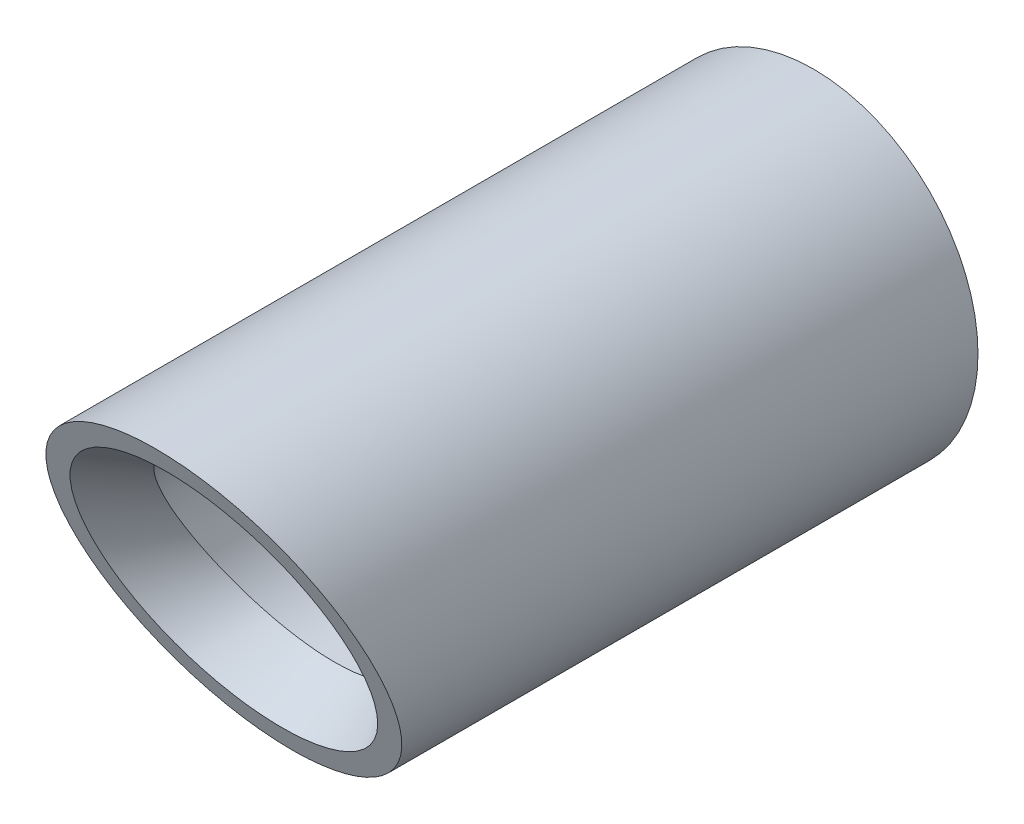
ISO-10303-21;
HEADER;
FILE_DESCRIPTION(('STEP AP214'),'2;1');
FILE_NAME('part.step','',(''),(''),'','','');
FILE_SCHEMA(('AUTOMOTIVE_DESIGN { 1 0 10303 214 1 1 1 1 }'));
ENDSEC;
DATA;
#1=APPLICATION_CONTEXT('core data for automotive mechanical design processes');
#2=APPLICATION_PROTOCOL_DEFINITION('international standard','automotive_design',2000,#1);
#3=PRODUCT_CONTEXT('',#1,'mechanical');
#4=PRODUCT('Part','Part','',(#3));
#5=PRODUCT_RELATED_PRODUCT_CATEGORY('part','',(#4));
#6=PRODUCT_DEFINITION_FORMATION('','',#4);
#7=PRODUCT_DEFINITION_CONTEXT('part definition',#1,'design');
#8=PRODUCT_DEFINITION('design','',#6,#7);
#9=PRODUCT_DEFINITION_SHAPE('','',#8);
#10=(LENGTH_UNIT() NAMED_UNIT(*) SI_UNIT(.MILLI.,.METRE.));
#11=(NAMED_UNIT(*) PLANE_ANGLE_UNIT() SI_UNIT($,.RADIAN.));
#12=(NAMED_UNIT(*) SI_UNIT($,.STERADIAN.) SOLID_ANGLE_UNIT());
#13=UNCERTAINTY_MEASURE_WITH_UNIT(LENGTH_MEASURE(1.E-05),#10,'distance_accuracy_value','');
#14=(GEOMETRIC_REPRESENTATION_CONTEXT(3) GLOBAL_UNCERTAINTY_ASSIGNED_CONTEXT((#13)) GLOBAL_UNIT_ASSIGNED_CONTEXT((#10,
#11,#12)) REPRESENTATION_CONTEXT('',''));
#15=CARTESIAN_POINT('',(0.,0.,0.));
#16=DIRECTION('',(0.,0.,1.));
#17=DIRECTION('',(1.,0.,0.));
#18=AXIS2_PLACEMENT_3D('',#15,#16,#17);
#19=CARTESIAN_POINT('',(0.,0.,0.));
#20=DIRECTION('',(0.,0.,1.));
#21=DIRECTION('',(1.,0.,0.));
#22=AXIS2_PLACEMENT_3D('',#19,#20,#21);
#23=PLANE('',#22);
#24=CARTESIAN_POINT('',(0.,0.,0.));
#25=DIRECTION('',(0.,0.,1.));
#26=DIRECTION('',(1.,0.,0.));
#27=AXIS2_PLACEMENT_3D('',#24,#25,#26);
#28=CIRCLE('',#27,7.5);
#29=CARTESIAN_POINT('',(7.5,0.,0.));
#30=VERTEX_POINT('',#29);
#31=EDGE_CURVE('E10',#30,#30,#28,.T.);
#32=ORIENTED_EDGE('',*,*,#31,.F.);
#33=EDGE_LOOP('',(#32));
#34=FACE_BOUND('',#33,.T.);
#35=CARTESIAN_POINT('',(0.,0.,0.));
#36=DIRECTION('',(0.,0.,1.));
#37=DIRECTION('',(1.,0.,0.));
#38=AXIS2_PLACEMENT_3D('',#35,#36,#37);
#39=CIRCLE('',#38,5.);
#40=CARTESIAN_POINT('',(5.,0.,0.));
#41=VERTEX_POINT('',#40);
#42=EDGE_CURVE('E43',#41,#41,#39,.T.);
#43=ORIENTED_EDGE('',*,*,#42,.T.);
#44=EDGE_LOOP('',(#43));
#45=FACE_BOUND('',#44,.T.);
#46=ADVANCED_FACE('F33',(#34,#45),#23,.F.);
#47=CARTESIAN_POINT('',(0.,0.,30.));
#48=DIRECTION('',(0.,0.,-1.));
#49=DIRECTION('',(-1.,0.,0.));
#50=AXIS2_PLACEMENT_3D('',#47,#48,#49);
#51=CYLINDRICAL_SURFACE('',#50,7.5);
#52=CARTESIAN_POINT('',(0.,0.,26.8933982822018));
#53=DIRECTION('',(0.,0.38268343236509,-0.923879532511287));
#54=DIRECTION('',(0.,-0.923879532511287,-0.38268343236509));
#55=AXIS2_PLACEMENT_3D('',#52,#53,#54);
#56=ELLIPSE('',#55,8.11794150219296,7.5);
#57=CARTESIAN_POINT('',(0.,-7.5,23.7867965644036));
#58=VERTEX_POINT('',#57);
#59=EDGE_CURVE('E48',#58,#58,#56,.T.);
#60=ORIENTED_EDGE('',*,*,#59,.T.);
#61=EDGE_LOOP('',(#60));
#62=FACE_BOUND('',#61,.T.);
#63=ORIENTED_EDGE('',*,*,#31,.T.);
#64=EDGE_LOOP('',(#63));
#65=FACE_BOUND('',#64,.T.);
#66=ADVANCED_FACE('F35',(#62,#65),#51,.T.);
#67=CARTESIAN_POINT('',(0.,0.,30.));
#68=DIRECTION('',(0.,0.,-1.));
#69=DIRECTION('',(-1.,0.,0.));
#70=AXIS2_PLACEMENT_3D('',#67,#68,#69);
#71=CYLINDRICAL_SURFACE('',#70,5.);
#72=CARTESIAN_POINT('',(-5.,0.,24.394575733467));
#73=CARTESIAN_POINT('',(-5.0000001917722,0.131660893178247,24.4659931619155));
#74=CARTESIAN_POINT('',(-4.9948000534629,0.263240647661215,24.537601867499));
#75=CARTESIAN_POINT('',(-4.9792248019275,0.460056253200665,24.64484302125));
#76=CARTESIAN_POINT('',(-4.97273599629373,0.525576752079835,24.6805655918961));
#77=CARTESIAN_POINT('',(-4.95717231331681,0.656337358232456,24.7519685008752));
#78=CARTESIAN_POINT('',(-4.94809744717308,0.721577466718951,24.7876488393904));
#79=CARTESIAN_POINT('',(-4.92735107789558,0.851799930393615,24.8589066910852));
#80=CARTESIAN_POINT('',(-4.91567655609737,0.916781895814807,24.8944840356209));
#81=CARTESIAN_POINT('',(-4.88973573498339,1.04635075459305,24.9654111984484));
#82=CARTESIAN_POINT('',(-4.87546946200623,1.11093765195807,25.0007610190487));
#83=CARTESIAN_POINT('',(-4.84434419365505,1.23964153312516,25.0711887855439));
#84=CARTESIAN_POINT('',(-4.82748500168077,1.30375848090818,25.1062667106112));
#85=CARTESIAN_POINT('',(-4.79119317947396,1.43138869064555,25.176184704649));
#86=CARTESIAN_POINT('',(-4.77176043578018,1.49490192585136,25.2110247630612));
#87=CARTESIAN_POINT('',(-4.70102018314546,1.71060013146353,25.3293647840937));
#88=CARTESIAN_POINT('',(-4.64347813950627,1.86124726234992,25.4120483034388));
#89=CARTESIAN_POINT('',(-4.51349959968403,2.15742897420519,25.5748479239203));
#90=CARTESIAN_POINT('',(-4.44106084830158,2.30296277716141,25.6549636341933));
#91=CARTESIAN_POINT('',(-4.28140794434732,2.58769547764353,25.8116531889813));
#92=CARTESIAN_POINT('',(-4.19419554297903,2.72689512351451,25.888227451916));
#93=CARTESIAN_POINT('',(-4.00521458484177,2.997585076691,26.0371752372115));
#94=CARTESIAN_POINT('',(-3.90343944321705,3.12907185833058,26.1095468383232));
#95=CARTESIAN_POINT('',(-3.69322247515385,3.37407031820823,26.244375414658));
#96=CARTESIAN_POINT('',(-3.58571393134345,3.48819632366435,26.3071719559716));
#97=CARTESIAN_POINT('',(-3.35896165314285,3.70704384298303,26.4275890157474));
#98=CARTESIAN_POINT('',(-3.23972580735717,3.81177158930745,26.4852129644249));
#99=CARTESIAN_POINT('',(-3.05260472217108,3.96080375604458,26.5671720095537));
#100=CARTESIAN_POINT('',(-2.98885889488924,4.00913414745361,26.5937434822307));
#101=CARTESIAN_POINT('',(-2.8587171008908,4.10294665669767,26.6452874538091));
#102=CARTESIAN_POINT('',(-2.7923218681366,4.14842955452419,26.6702603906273));
#103=CARTESIAN_POINT('',(-2.58931135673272,4.28036070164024,26.7427550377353));
#104=CARTESIAN_POINT('',(-2.4488301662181,4.36232425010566,26.7878705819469));
#105=CARTESIAN_POINT('',(-2.24094360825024,4.47025888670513,26.847216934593));
#106=CARTESIAN_POINT('',(-2.17714794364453,4.50167847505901,26.864483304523));
#107=CARTESIAN_POINT('',(-2.04796709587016,4.56189713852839,26.8976180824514));
#108=CARTESIAN_POINT('',(-1.98258194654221,4.59069626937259,26.9134865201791));
#109=CARTESIAN_POINT('',(-1.85035051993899,4.64557076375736,26.9437305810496));
#110=CARTESIAN_POINT('',(-1.78350440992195,4.67164643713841,26.9581063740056));
#111=CARTESIAN_POINT('',(-1.64847054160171,4.72098620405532,26.9852562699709));
#112=CARTESIAN_POINT('',(-1.58028294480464,4.74425063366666,26.9980305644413));
#113=CARTESIAN_POINT('',(-1.44273756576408,4.78787121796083,27.0219238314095));
#114=CARTESIAN_POINT('',(-1.37338040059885,4.80822885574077,27.0330436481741));
#115=CARTESIAN_POINT('',(-1.23364286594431,4.84596348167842,27.0536709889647));
#116=CARTESIAN_POINT('',(-1.1632627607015,4.86334122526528,27.0631789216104));
#117=CARTESIAN_POINT('',(-1.02161396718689,4.89505586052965,27.0805509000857));
#118=CARTESIAN_POINT('',(-0.950345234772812,4.90939260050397,27.088414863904));
#119=CARTESIAN_POINT('',(-0.807088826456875,4.9349674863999,27.1024190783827));
#120=CARTESIAN_POINT('',(-0.735101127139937,4.94620553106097,27.1085592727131));
#121=CARTESIAN_POINT('',(-0.53538934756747,4.97291451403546,27.1231872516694));
#122=CARTESIAN_POINT('',(-0.407069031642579,4.98506755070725,27.1298888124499));
#123=CARTESIAN_POINT('',(-0.149732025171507,4.99941904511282,27.1378309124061));
#124=CARTESIAN_POINT('',(-0.0207154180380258,5.00161866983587,27.1390720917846));
#125=CARTESIAN_POINT('',(0.237003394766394,4.99604203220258,27.1359816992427));
#126=CARTESIAN_POINT('',(0.365705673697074,4.98826837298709,27.1316515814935));
#127=CARTESIAN_POINT('',(0.621838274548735,4.96285000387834,27.1176745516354));
#128=CARTESIAN_POINT('',(0.749268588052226,4.94520522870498,27.1080276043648));
#129=CARTESIAN_POINT('',(0.996721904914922,4.90119231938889,27.0839225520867));
#130=CARTESIAN_POINT('',(1.11683465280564,4.87521064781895,27.0696774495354));
#131=CARTESIAN_POINT('',(1.35419257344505,4.81468225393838,27.0363868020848));
#132=CARTESIAN_POINT('',(1.47143785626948,4.78013586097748,27.0173414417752));
#133=CARTESIAN_POINT('',(1.70237780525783,4.7028433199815,26.9748696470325));
#134=CARTESIAN_POINT('',(1.81607232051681,4.66009682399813,26.9514430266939));
#135=CARTESIAN_POINT('',(2.0392360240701,4.56685270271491,26.9002890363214));
#136=CARTESIAN_POINT('',(2.14870506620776,4.51635480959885,26.8725615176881));
#137=CARTESIAN_POINT('',(2.36716103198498,4.40591938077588,26.8118848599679));
#138=CARTESIAN_POINT('',(2.47595118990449,4.34568370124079,26.778770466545));
#139=CARTESIAN_POINT('',(2.68781504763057,4.21793225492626,26.7085629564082));
#140=CARTESIAN_POINT('',(2.7908886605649,4.15041637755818,26.6714697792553));
#141=CARTESIAN_POINT('',(2.9908760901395,4.00870099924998,26.5935442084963));
#142=CARTESIAN_POINT('',(3.087788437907,3.93449991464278,26.5527109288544));
#143=CARTESIAN_POINT('',(3.27507096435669,3.78003313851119,26.4676739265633));
#144=CARTESIAN_POINT('',(3.36544078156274,3.69976711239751,26.4234700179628));
#145=CARTESIAN_POINT('',(3.54819504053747,3.52531321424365,26.3274946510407));
#146=CARTESIAN_POINT('',(3.63985757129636,3.43053853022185,26.2754100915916));
#147=CARTESIAN_POINT('',(3.77088439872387,3.28401147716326,26.1948044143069));
#148=CARTESIAN_POINT('',(3.81348656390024,3.23443585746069,26.1675195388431));
#149=CARTESIAN_POINT('',(3.89653655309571,3.1338875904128,26.1122442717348));
#150=CARTESIAN_POINT('',(3.93698438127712,3.08291494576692,26.0842538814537));
#151=CARTESIAN_POINT('',(4.01568996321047,2.97967284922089,26.0275382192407));
#152=CARTESIAN_POINT('',(4.05394697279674,2.92740296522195,25.9988127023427));
#153=CARTESIAN_POINT('',(4.12823056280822,2.8216813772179,25.9406623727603));
#154=CARTESIAN_POINT('',(4.16425715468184,2.76822967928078,25.9112375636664));
#155=CARTESIAN_POINT('',(4.23406490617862,2.66023111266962,25.8517362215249));
#156=CARTESIAN_POINT('',(4.26784598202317,2.60568420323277,25.8216596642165));
#157=CARTESIAN_POINT('',(4.33316519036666,2.49555160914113,25.7609774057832));
#158=CARTESIAN_POINT('',(4.36470328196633,2.43996590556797,25.7303716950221));
#159=CARTESIAN_POINT('',(4.42928689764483,2.32089525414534,25.6648348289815));
#160=CARTESIAN_POINT('',(4.46203502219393,2.25728491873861,25.6298375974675));
#161=CARTESIAN_POINT('',(4.52465402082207,2.12899141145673,25.5592539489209));
#162=CARTESIAN_POINT('',(4.55452484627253,2.06430822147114,25.5236675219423));
#163=CARTESIAN_POINT('',(4.63982098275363,1.86876258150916,25.4161768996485));
#164=CARTESIAN_POINT('',(4.69093916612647,1.73638703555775,25.343531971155));
#165=CARTESIAN_POINT('',(4.7588872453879,1.53557728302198,25.2333339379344));
#166=CARTESIAN_POINT('',(4.7800866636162,1.46824626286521,25.1963851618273));
#167=CARTESIAN_POINT('',(4.81958410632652,1.33288227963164,25.12221107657));
#168=CARTESIAN_POINT('',(4.83788214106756,1.26484931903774,25.0849857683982));
#169=CARTESIAN_POINT('',(4.8715547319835,1.12823145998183,25.0102254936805));
#170=CARTESIAN_POINT('',(4.88692919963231,1.05964654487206,24.9726905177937));
#171=CARTESIAN_POINT('',(4.91475235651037,0.922029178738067,24.897355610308));
#172=CARTESIAN_POINT('',(4.92720100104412,0.852996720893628,24.8595556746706));
#173=CARTESIAN_POINT('',(4.95030514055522,0.707427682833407,24.7799114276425));
#174=CARTESIAN_POINT('',(4.96064451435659,0.630849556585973,24.7380510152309));
#175=CARTESIAN_POINT('',(4.97776178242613,0.477338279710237,24.6542524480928));
#176=CARTESIAN_POINT('',(4.98453961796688,0.400405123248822,24.612314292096));
#177=CARTESIAN_POINT('',(4.9945254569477,0.246325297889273,24.528399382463));
#178=CARTESIAN_POINT('',(4.99773343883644,0.169178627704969,24.4864226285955));
#179=CARTESIAN_POINT('',(5.00057460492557,0.0147677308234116,24.4025610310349));
#180=CARTESIAN_POINT('',(5.00020739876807,-0.0624965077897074,24.3606761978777));
#181=CARTESIAN_POINT('',(4.99372347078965,-0.294313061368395,24.2351951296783));
#182=CARTESIAN_POINT('',(4.98222297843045,-0.448866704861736,24.1517845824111));
#183=CARTESIAN_POINT('',(4.95418442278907,-0.679761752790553,24.0275092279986));
#184=CARTESIAN_POINT('',(4.94303850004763,-0.756579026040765,23.9862198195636));
#185=CARTESIAN_POINT('',(4.91713910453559,-0.909823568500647,23.9040316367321));
#186=CARTESIAN_POINT('',(4.90238560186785,-0.986250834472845,23.8631328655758));
#187=CARTESIAN_POINT('',(4.86874755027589,-1.14094515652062,23.780550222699));
#188=CARTESIAN_POINT('',(4.84974871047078,-1.21919543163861,23.7388815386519));
#189=CARTESIAN_POINT('',(4.80791366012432,-1.37494364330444,23.6560661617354));
#190=CARTESIAN_POINT('',(4.78507746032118,-1.45244158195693,23.6149194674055));
#191=CARTESIAN_POINT('',(4.73555284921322,-1.60657762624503,23.5333279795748));
#192=CARTESIAN_POINT('',(4.70886425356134,-1.68321569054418,23.4928832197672));
#193=CARTESIAN_POINT('',(4.65162229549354,-1.83549026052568,23.4128451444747));
#194=CARTESIAN_POINT('',(4.6210688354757,-1.91112674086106,23.3732518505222));
#195=CARTESIAN_POINT('',(4.55612675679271,-2.06116240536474,23.2949132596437));
#196=CARTESIAN_POINT('',(4.52173885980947,-2.13556181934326,23.256167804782));
#197=CARTESIAN_POINT('',(4.44914874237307,-2.28294195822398,23.179579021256));
#198=CARTESIAN_POINT('',(4.41094687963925,-2.35592281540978,23.1417356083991));
#199=CARTESIAN_POINT('',(4.33072655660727,-2.50032527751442,23.0671771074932));
#200=CARTESIAN_POINT('',(4.28870888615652,-2.5717472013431,23.0304617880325));
#201=CARTESIAN_POINT('',(4.20085934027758,-2.71287495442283,22.9582345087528));
#202=CARTESIAN_POINT('',(4.15502613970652,-2.78258017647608,22.9227229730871));
#203=CARTESIAN_POINT('',(4.06297994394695,-2.91517467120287,22.8553556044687));
#204=CARTESIAN_POINT('',(4.01702031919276,-2.97819854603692,22.8234183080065));
#205=CARTESIAN_POINT('',(3.92189315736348,-3.10239787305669,22.7607171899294));
#206=CARTESIAN_POINT('',(3.87272523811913,-3.16357310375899,22.7299535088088));
#207=CARTESIAN_POINT('',(3.77124059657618,-3.28389045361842,22.6696975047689));
#208=CARTESIAN_POINT('',(3.71892427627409,-3.34303283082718,22.6402050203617));
#209=CARTESIAN_POINT('',(3.61122517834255,-3.45909249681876,22.5825013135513));
#210=CARTESIAN_POINT('',(3.555842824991,-3.51601009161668,22.5542899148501));
#211=CARTESIAN_POINT('',(3.4420946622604,-3.62743942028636,22.4992706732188));
#212=CARTESIAN_POINT('',(3.38373026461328,-3.6819522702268,22.4724621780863));
#213=CARTESIAN_POINT('',(3.26412236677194,-3.7883927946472,22.4202809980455));
#214=CARTESIAN_POINT('',(3.20287966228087,-3.84032117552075,22.3949079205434));
#215=CARTESIAN_POINT('',(3.01490132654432,-3.99202456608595,22.3211612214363));
#216=CARTESIAN_POINT('',(2.88388050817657,-4.08775218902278,22.2751431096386));
#217=CARTESIAN_POINT('',(2.68817860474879,-4.21649254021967,22.2136241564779));
#218=CARTESIAN_POINT('',(2.62754830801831,-4.25454289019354,22.1954944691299));
#219=CARTESIAN_POINT('',(2.50444247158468,-4.32815311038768,22.1604859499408));
#220=CARTESIAN_POINT('',(2.44196702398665,-4.36371310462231,22.1436070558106));
#221=CARTESIAN_POINT('',(2.25193124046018,-4.46649006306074,22.0949876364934));
#222=CARTESIAN_POINT('',(2.12172217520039,-4.52982990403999,22.065251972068));
#223=CARTESIAN_POINT('',(1.85541366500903,-4.64526630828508,22.0112983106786));
#224=CARTESIAN_POINT('',(1.71931732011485,-4.69736870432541,21.9870774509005));
#225=CARTESIAN_POINT('',(1.44227716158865,-4.78969197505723,21.9443679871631));
#226=CARTESIAN_POINT('',(1.30133356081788,-4.82991337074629,21.9258791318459));
#227=CARTESIAN_POINT('',(1.02941170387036,-4.89468538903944,21.8961199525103));
#228=CARTESIAN_POINT('',(0.898758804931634,-4.92036176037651,21.884330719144));
#229=CARTESIAN_POINT('',(0.701344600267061,-4.9510156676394,21.8702194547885));
#230=CARTESIAN_POINT('',(0.63529678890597,-4.95992382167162,21.866110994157));
#231=CARTESIAN_POINT('',(0.502827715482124,-4.97509870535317,21.8591509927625));
#232=CARTESIAN_POINT('',(0.436406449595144,-4.98136540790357,21.8562994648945));
#233=CARTESIAN_POINT('',(0.303338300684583,-4.99123594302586,21.8518446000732));
#234=CARTESIAN_POINT('',(0.236691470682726,-4.99484036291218,21.8502409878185));
#235=CARTESIAN_POINT('',(0.136644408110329,-4.99824390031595,21.848753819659));
#236=CARTESIAN_POINT('',(0.103281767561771,-4.99904455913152,21.8484111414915));
#237=CARTESIAN_POINT('',(0.0365454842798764,-4.9999778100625,21.8480018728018));
#238=CARTESIAN_POINT('',(0.00317184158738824,-5.0001104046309,21.8479352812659));
#239=CARTESIAN_POINT('',(-0.0969439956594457,-4.99950557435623,21.8482536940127));
#240=CARTESIAN_POINT('',(-0.16368181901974,-4.99776556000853,21.849156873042));
#241=CARTESIAN_POINT('',(-0.297004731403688,-4.99161719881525,21.8521549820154));
#242=CARTESIAN_POINT('',(-0.363589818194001,-4.98720881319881,21.8542499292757));
#243=CARTESIAN_POINT('',(-0.49386271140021,-4.97596247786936,21.8594426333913));
#244=CARTESIAN_POINT('',(-0.557561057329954,-4.96922739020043,21.8624975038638));
#245=CARTESIAN_POINT('',(-0.684589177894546,-4.95332584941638,21.8696233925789));
#246=CARTESIAN_POINT('',(-0.747918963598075,-4.94415946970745,21.8736943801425));
#247=CARTESIAN_POINT('',(-0.937179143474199,-4.91304680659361,21.8876778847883));
#248=CARTESIAN_POINT('',(-1.06241774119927,-4.88748376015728,21.8993622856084));
#249=CARTESIAN_POINT('',(-1.24813992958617,-4.84212923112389,21.9201181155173));
#250=CARTESIAN_POINT('',(-1.30969632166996,-4.82584110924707,21.9275756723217));
#251=CARTESIAN_POINT('',(-1.43201037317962,-4.79096940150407,21.9436175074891));
#252=CARTESIAN_POINT('',(-1.49276807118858,-4.77238592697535,21.9522017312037));
#253=CARTESIAN_POINT('',(-1.61337844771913,-4.73297328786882,21.9704809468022));
#254=CARTESIAN_POINT('',(-1.67323113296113,-4.71214413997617,21.9801759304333));
#255=CARTESIAN_POINT('',(-1.79195714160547,-4.66828603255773,22.0005994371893));
#256=CARTESIAN_POINT('',(-1.85083030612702,-4.64525672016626,22.0113281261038));
#257=CARTESIAN_POINT('',(-1.96812852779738,-4.5967968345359,22.0339735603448));
#258=CARTESIAN_POINT('',(-2.02654159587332,-4.57134270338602,22.045902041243));
#259=CARTESIAN_POINT('',(-2.14217977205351,-4.5183086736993,22.0707587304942));
#260=CARTESIAN_POINT('',(-2.19940476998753,-4.4907285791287,22.0836870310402));
#261=CARTESIAN_POINT('',(-2.36918513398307,-4.40488842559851,22.1240612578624));
#262=CARTESIAN_POINT('',(-2.47982607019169,-4.34353669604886,22.1530927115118));
#263=CARTESIAN_POINT('',(-2.6953308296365,-4.21320047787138,22.21512291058));
#264=CARTESIAN_POINT('',(-2.8001941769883,-4.14421536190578,22.2481219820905));
#265=CARTESIAN_POINT('',(-3.00359881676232,-3.99924746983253,22.3178854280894));
#266=CARTESIAN_POINT('',(-3.10214233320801,-3.92326717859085,22.3546484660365));
#267=CARTESIAN_POINT('',(-3.24747472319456,-3.80239009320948,22.413517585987));
#268=CARTESIAN_POINT('',(-3.29671013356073,-3.75977638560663,22.434338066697));
#269=CARTESIAN_POINT('',(-3.39324531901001,-3.67288774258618,22.4769430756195));
#270=CARTESIAN_POINT('',(-3.44054537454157,-3.6286130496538,22.4987274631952));
#271=CARTESIAN_POINT('',(-3.57950869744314,-3.4933952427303,22.5653671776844));
#272=CARTESIAN_POINT('',(-3.66824580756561,-3.40004949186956,22.611513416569));
#273=CARTESIAN_POINT('',(-3.83745775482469,-3.20785592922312,22.7074497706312));
#274=CARTESIAN_POINT('',(-3.91792925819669,-3.10900592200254,22.7572413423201));
#275=CARTESIAN_POINT('',(-4.07046058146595,-2.90644316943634,22.8597285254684));
#276=CARTESIAN_POINT('',(-4.14252003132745,-2.80273021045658,22.9124242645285));
#277=CARTESIAN_POINT('',(-4.28458886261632,-2.58094747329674,23.0258246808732));
#278=CARTESIAN_POINT('',(-4.35372299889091,-2.46246033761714,23.0868106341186));
#279=CARTESIAN_POINT('',(-4.48153364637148,-2.22136715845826,23.2115299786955));
#280=CARTESIAN_POINT('',(-4.54020921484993,-2.09876074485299,23.275263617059));
#281=CARTESIAN_POINT('',(-4.64701322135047,-1.85028267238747,23.4050945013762));
#282=CARTESIAN_POINT('',(-4.69514427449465,-1.72441183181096,23.4711911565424));
#283=CARTESIAN_POINT('',(-4.75940942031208,-1.53379348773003,23.5718734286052));
#284=CARTESIAN_POINT('',(-4.77950969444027,-1.46995016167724,23.6056913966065));
#285=CARTESIAN_POINT('',(-4.81708228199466,-1.34170814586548,23.6737307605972));
#286=CARTESIAN_POINT('',(-4.83455467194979,-1.27730947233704,23.7079521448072));
#287=CARTESIAN_POINT('',(-4.87563734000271,-1.11297871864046,23.7954404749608));
#288=CARTESIAN_POINT('',(-4.89743395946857,-1.01272599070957,23.848966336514));
#289=CARTESIAN_POINT('',(-4.93477359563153,-0.811470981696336,23.9567395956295));
#290=CARTESIAN_POINT('',(-4.95031741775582,-0.710468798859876,24.0109868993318));
#291=CARTESIAN_POINT('',(-4.97517264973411,-0.507992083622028,24.1199529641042));
#292=CARTESIAN_POINT('',(-4.98448599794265,-0.406517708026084,24.1746715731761));
#293=CARTESIAN_POINT('',(-4.99689998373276,-0.203346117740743,24.2844140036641));
#294=CARTESIAN_POINT('',(-4.99999985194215,-0.101648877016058,24.3394378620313));
#295=CARTESIAN_POINT('',(-5.,0.,24.394575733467));
#296=B_SPLINE_CURVE_WITH_KNOTS('',3,(#72,#73,#74,#75,#76,#77,#78,#79,#80,#81,#82,#83,#84,#85,
#86,#87,#88,#89,#90,#91,#92,#93,#94,#95,#96,#97,#98,#99,#100,#101,#102,#103,#104,#105,#106,#107,
#108,#109,#110,#111,#112,#113,#114,#115,#116,#117,#118,#119,#120,#121,#122,#123,#124,#125,#126,
#127,#128,#129,#130,#131,#132,#133,#134,#135,#136,#137,#138,#139,#140,#141,#142,#143,#144,#145,
#146,#147,#148,#149,#150,#151,#152,#153,#154,#155,#156,#157,#158,#159,#160,#161,#162,#163,#164,
#165,#166,#167,#168,#169,#170,#171,#172,#173,#174,#175,#176,#177,#178,#179,#180,#181,#182,#183,
#184,#185,#186,#187,#188,#189,#190,#191,#192,#193,#194,#195,#196,#197,#198,#199,#200,#201,#202,
#203,#204,#205,#206,#207,#208,#209,#210,#211,#212,#213,#214,#215,#216,#217,#218,#219,#220,#221,
#222,#223,#224,#225,#226,#227,#228,#229,#230,#231,#232,#233,#234,#235,#236,#237,#238,#239,#240,
#241,#242,#243,#244,#245,#246,#247,#248,#249,#250,#251,#252,#253,#254,#255,#256,#257,#258,#259,
#260,#261,#262,#263,#264,#265,#266,#267,#268,#269,#270,#271,#272,#273,#274,#275,#276,#277,#278,
#279,#280,#281,#282,#283,#284,#285,#286,#287,#288,#289,#290,#291,#292,#293,#294,#295),
.UNSPECIFIED.,.T.,.F.,(4,2,2,2,2,2,2,2,2,2,2,2,2,2,2,2,2,2,2,2,2,2,2,2,2,2,2,2,2,2,2,2,2,2,2,2,
2,2,2,2,2,2,2,2,2,2,2,2,2,2,2,2,2,2,2,2,2,2,2,2,2,2,2,2,2,2,2,2,2,2,2,2,2,2,2,2,2,2,2,2,2,2,2,2,
2,2,2,2,2,2,2,2,2,2,2,2,2,2,2,2,2,2,2,2,2,2,2,2,2,2,2,4),(0.,0.449269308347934,
0.673956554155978,0.898642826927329,1.12359137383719,1.34853763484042,1.57350096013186,
1.79847420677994,2.341390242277,2.8843885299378,3.42732249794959,3.97050274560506,
4.47649991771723,4.98215901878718,5.23494571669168,5.48766286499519,5.99293105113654,
6.21241376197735,6.43189180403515,6.65134484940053,6.87077163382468,7.09008605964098,
7.30934480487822,7.52861448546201,7.74789133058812,8.13456394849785,8.52119122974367,
8.9077176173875,9.2942465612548,9.6649603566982,10.0356598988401,10.4063751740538,
10.7771032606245,11.162753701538,11.5484100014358,11.9341579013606,12.3199270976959,
12.7447426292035,12.9571977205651,13.169652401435,13.3821788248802,13.5947041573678,
13.8072374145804,14.0197745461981,14.2586457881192,14.4975210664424,14.9752072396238,
15.2141902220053,15.4531723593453,15.6921617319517,15.9311547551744,16.1947288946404,
16.458307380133,16.7218874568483,16.9854963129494,17.5127908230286,17.7764944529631,
18.0402002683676,18.312114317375,18.5840276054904,18.8559539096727,19.1278870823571,
19.3997691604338,19.6716257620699,19.9434262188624,20.2153214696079,20.4680961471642,
20.7209009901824,20.9736736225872,21.2264113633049,21.4790305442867,21.7315802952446,
22.2365247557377,22.457992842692,22.6794498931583,23.1222185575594,23.5647568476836,
24.0072757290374,24.4077540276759,24.6080167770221,24.8082815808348,25.0085021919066,
25.1086173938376,25.2087322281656,25.4089597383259,25.6091901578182,25.8015103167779,
25.9938246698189,26.3783410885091,26.570630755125,26.7629110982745,26.9551900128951,
27.1474998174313,27.3419179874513,27.5363541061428,27.9252914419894,28.314260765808,
28.7030924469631,28.9081346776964,29.113147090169,29.5231282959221,29.9332742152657,
30.3434381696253,30.7933465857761,31.2432955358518,31.6931327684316,31.9180643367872,
32.1429893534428,32.4899577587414,32.8368814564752,33.1836971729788,33.5305558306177),.UNSPECIFIED.);
#297=CARTESIAN_POINT('',(-5.,0.,24.394575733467));
#298=VERTEX_POINT('',#297);
#299=EDGE_CURVE('E59',#298,#298,#296,.T.);
#300=ORIENTED_EDGE('',*,*,#299,.F.);
#301=EDGE_LOOP('',(#300));
#302=FACE_BOUND('',#301,.T.);
#303=ORIENTED_EDGE('',*,*,#42,.F.);
#304=EDGE_LOOP('',(#303));
#305=FACE_BOUND('',#304,.T.);
#306=ADVANCED_FACE('F72',(#302,#305),#71,.F.);
#307=CARTESIAN_POINT('',(55.3029326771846,7.5,30.));
#308=DIRECTION('',(0.,0.38268343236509,-0.923879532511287));
#309=DIRECTION('',(0.,0.923879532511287,0.38268343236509));
#310=AXIS2_PLACEMENT_3D('',#307,#308,#309);
#311=PLANE('',#310);
#312=CARTESIAN_POINT('',(0.,6.38581929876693,29.5384912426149));
#313=CARTESIAN_POINT('',(-0.221725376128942,6.38581929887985,29.5384912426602));
#314=CARTESIAN_POINT('',(-0.441419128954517,6.37480321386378,29.5339282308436));
#315=CARTESIAN_POINT('',(-0.767982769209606,6.34213692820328,29.5203974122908));
#316=CARTESIAN_POINT('',(-0.876341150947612,6.32855780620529,29.5147727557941));
#317=CARTESIAN_POINT('',(-1.09207732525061,6.29608250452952,29.5013210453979));
#318=CARTESIAN_POINT('',(-1.19945471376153,6.27718655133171,29.4934940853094));
#319=CARTESIAN_POINT('',(-1.41324225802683,6.23414034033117,29.4756637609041));
#320=CARTESIAN_POINT('',(-1.51991629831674,6.20984185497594,29.465598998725));
#321=CARTESIAN_POINT('',(-1.73216195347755,6.15591765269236,29.4432628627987));
#322=CARTESIAN_POINT('',(-1.83773316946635,6.12629216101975,29.430991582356));
#323=CARTESIAN_POINT('',(-2.04710698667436,6.06193928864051,29.404335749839));
#324=CARTESIAN_POINT('',(-2.15090959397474,6.02721190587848,29.3899511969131));
#325=CARTESIAN_POINT('',(-2.35608081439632,5.95288013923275,29.3591619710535));
#326=CARTESIAN_POINT('',(-2.45744915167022,5.91327571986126,29.3427572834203));
#327=CARTESIAN_POINT('',(-2.6570875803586,5.82941490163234,29.3080209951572));
#328=CARTESIAN_POINT('',(-2.75554170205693,5.78518046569,29.2896984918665));
#329=CARTESIAN_POINT('',(-2.94973040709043,5.69211887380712,29.2511511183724));
#330=CARTESIAN_POINT('',(-3.04546470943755,5.6432916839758,29.230926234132));
#331=CARTESIAN_POINT('',(-3.23422217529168,5.5410596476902,29.1885803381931));
#332=CARTESIAN_POINT('',(-3.32724533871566,5.48765480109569,29.1664593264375));
#333=CARTESIAN_POINT('',(-3.51058948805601,5.37628258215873,29.1203274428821));
#334=CARTESIAN_POINT('',(-3.60091062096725,5.31831521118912,29.0963165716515));
#335=CARTESIAN_POINT('',(-3.86783331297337,5.13759199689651,29.0214585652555));
#336=CARTESIAN_POINT('',(-4.04000745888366,5.00801014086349,28.9677840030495));
#337=CARTESIAN_POINT('',(-4.36630549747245,4.73636666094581,28.8552655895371));
#338=CARTESIAN_POINT('',(-4.52141953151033,4.59366613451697,28.7961570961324));
#339=CARTESIAN_POINT('',(-4.81605816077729,4.29491225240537,28.6724091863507));
#340=CARTESIAN_POINT('',(-4.95558048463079,4.13885899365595,28.6077698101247));
#341=CARTESIAN_POINT('',(-5.15318440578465,3.89477415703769,28.5066665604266));
#342=CARTESIAN_POINT('',(-5.2172200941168,3.81154242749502,28.4721908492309));
#343=CARTESIAN_POINT('',(-5.34095730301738,3.64231568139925,28.4020948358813));
#344=CARTESIAN_POINT('',(-5.40065844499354,3.55632112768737,28.366474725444));
#345=CARTESIAN_POINT('',(-5.51505642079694,3.3825474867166,28.2944953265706));
#346=CARTESIAN_POINT('',(-5.56989086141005,3.29466217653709,28.2580920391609));
#347=CARTESIAN_POINT('',(-5.67488089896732,3.11691431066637,28.1844664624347));
#348=CARTESIAN_POINT('',(-5.72503628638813,3.02705191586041,28.1472442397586));
#349=CARTESIAN_POINT('',(-5.82071679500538,2.84537090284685,28.0719895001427));
#350=CARTESIAN_POINT('',(-5.86624191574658,2.75355228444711,28.0339569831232));
#351=CARTESIAN_POINT('',(-5.95271088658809,2.56797952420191,27.9570902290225));
#352=CARTESIAN_POINT('',(-5.99365473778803,2.47422567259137,27.9182561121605));
#353=CARTESIAN_POINT('',(-6.07101015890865,2.28480198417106,27.8397942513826));
#354=CARTESIAN_POINT('',(-6.10742080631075,2.18894211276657,27.8000877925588));
#355=CARTESIAN_POINT('',(-6.17557226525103,1.99546790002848,27.7199481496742));
#356=CARTESIAN_POINT('',(-6.20731307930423,1.8978538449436,27.6795150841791));
#357=CARTESIAN_POINT('',(-6.26598917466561,1.70141516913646,27.5981475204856));
#358=CARTESIAN_POINT('',(-6.29292445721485,1.60259054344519,27.5572130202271));
#359=CARTESIAN_POINT('',(-6.34185379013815,1.40427404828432,27.4750676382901));
#360=CARTESIAN_POINT('',(-6.36384767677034,1.30478244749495,27.4338568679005));
#361=CARTESIAN_POINT('',(-6.40275917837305,1.10567422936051,27.3513835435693));
#362=CARTESIAN_POINT('',(-6.41978446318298,1.00587918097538,27.3100470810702));
#363=CARTESIAN_POINT('',(-6.44897121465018,0.805805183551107,27.2271737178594));
#364=CARTESIAN_POINT('',(-6.46113251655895,0.705526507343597,27.1856369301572));
#365=CARTESIAN_POINT('',(-6.48058709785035,0.504485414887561,27.1023629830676));
#366=CARTESIAN_POINT('',(-6.48788037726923,0.403722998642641,27.0606258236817));
#367=CARTESIAN_POINT('',(-6.49759503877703,0.201714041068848,26.9769509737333));
#368=CARTESIAN_POINT('',(-6.50001649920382,0.100467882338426,26.935013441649));
#369=CARTESIAN_POINT('',(-6.49998333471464,-0.102510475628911,26.8509370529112));
#370=CARTESIAN_POINT('',(-6.4974773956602,-0.204493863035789,26.8086941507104));
#371=CARTESIAN_POINT('',(-6.48751825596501,-0.408370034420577,26.7242458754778));
#372=CARTESIAN_POINT('',(-6.48006509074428,-0.510262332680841,26.6820407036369));
#373=CARTESIAN_POINT('',(-6.46024374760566,-0.712874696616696,26.5981159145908));
#374=CARTESIAN_POINT('',(-6.44790356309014,-0.813667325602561,26.5563662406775));
#375=CARTESIAN_POINT('',(-6.41841107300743,-1.01423599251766,26.4732879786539));
#376=CARTESIAN_POINT('',(-6.40125869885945,-1.11401191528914,26.4319594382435));
#377=CARTESIAN_POINT('',(-6.34265339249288,-1.41182928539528,26.308599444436));
#378=CARTESIAN_POINT('',(-6.2941190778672,-1.60837444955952,26.2271877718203));
#379=CARTESIAN_POINT('',(-6.20680621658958,-1.90012596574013,26.1063403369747));
#380=CARTESIAN_POINT('',(-6.17528335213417,-1.99686543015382,26.0662695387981));
#381=CARTESIAN_POINT('',(-6.10734789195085,-2.18931116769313,25.9865559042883));
#382=CARTESIAN_POINT('',(-6.07093541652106,-2.28501737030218,25.9469130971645));
#383=CARTESIAN_POINT('',(-5.9931676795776,-2.47538575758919,25.8680599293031));
#384=CARTESIAN_POINT('',(-5.95173346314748,-2.57009485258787,25.8288301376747));
#385=CARTESIAN_POINT('',(-5.86424986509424,-2.75749882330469,25.751204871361));
#386=CARTESIAN_POINT('',(-5.81820074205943,-2.85019324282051,25.7128095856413));
#387=CARTESIAN_POINT('',(-5.72197324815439,-3.03250485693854,25.6372936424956));
#388=CARTESIAN_POINT('',(-5.67170189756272,-3.12237924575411,25.6000664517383));
#389=CARTESIAN_POINT('',(-5.56685291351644,-3.29957334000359,25.5266702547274));
#390=CARTESIAN_POINT('',(-5.51227539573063,-3.38689263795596,25.4905014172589));
#391=CARTESIAN_POINT('',(-5.22864750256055,-3.81711511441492,25.3122974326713));
#392=CARTESIAN_POINT('',(-4.96764413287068,-4.1410602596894,25.1781149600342));
#393=CARTESIAN_POINT('',(-4.520953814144,-4.59421234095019,24.9904132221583));
#394=CARTESIAN_POINT('',(-4.36484523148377,-4.73766733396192,24.9309922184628));
#395=CARTESIAN_POINT('',(-4.03918291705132,-5.00865385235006,24.818745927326));
#396=CARTESIAN_POINT('',(-3.8696279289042,-5.13618682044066,24.7659200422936));
#397=CARTESIAN_POINT('',(-3.60593569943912,-5.31500481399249,24.6918512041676));
#398=CARTESIAN_POINT('',(-3.51639846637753,-5.37258638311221,24.6680001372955));
#399=CARTESIAN_POINT('',(-3.33398539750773,-5.48362931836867,24.6220046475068));
#400=CARTESIAN_POINT('',(-3.24111017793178,-5.53709040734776,24.5998603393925));
#401=CARTESIAN_POINT('',(-3.0519611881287,-5.63982112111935,24.5573078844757));
#402=CARTESIAN_POINT('',(-2.95536414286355,-5.68921673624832,24.5368475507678));
#403=CARTESIAN_POINT('',(-2.80829837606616,-5.75987333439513,24.5075806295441));
#404=CARTESIAN_POINT('',(-2.75891487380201,-5.78285268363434,24.4980622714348));
#405=CARTESIAN_POINT('',(-2.6595690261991,-5.82758516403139,24.4795334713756));
#406=CARTESIAN_POINT('',(-2.6096066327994,-5.8493382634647,24.4705230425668));
#407=CARTESIAN_POINT('',(-2.50924748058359,-5.89153787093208,24.4530433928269));
#408=CARTESIAN_POINT('',(-2.45886485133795,-5.91199562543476,24.4445695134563));
#409=CARTESIAN_POINT('',(-2.35769387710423,-5.95162764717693,24.4281533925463));
#410=CARTESIAN_POINT('',(-2.30690548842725,-5.97080188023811,24.4202111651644));
#411=CARTESIAN_POINT('',(-2.15393181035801,-6.02639985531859,24.3971817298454));
#412=CARTESIAN_POINT('',(-2.05113800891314,-6.06089887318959,24.3828917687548));
#413=CARTESIAN_POINT('',(-1.84392873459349,-6.12476756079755,24.3564364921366));
#414=CARTESIAN_POINT('',(-1.7395132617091,-6.15413723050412,24.3442711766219));
#415=CARTESIAN_POINT('',(-1.58167456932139,-6.19434716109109,24.3276156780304));
#416=CARTESIAN_POINT('',(-1.52885909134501,-6.20710970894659,24.3223292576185));
#417=CARTESIAN_POINT('',(-1.42282310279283,-6.23135368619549,24.3122870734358));
#418=CARTESIAN_POINT('',(-1.36960281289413,-6.24283514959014,24.3075312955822));
#419=CARTESIAN_POINT('',(-1.26275644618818,-6.2645172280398,24.2985502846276));
#420=CARTESIAN_POINT('',(-1.2090587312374,-6.27470682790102,24.2943296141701));
#421=CARTESIAN_POINT('',(-1.10120866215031,-6.29377139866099,24.2864328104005));
#422=CARTESIAN_POINT('',(-1.04705652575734,-6.3026464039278,24.2827566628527));
#423=CARTESIAN_POINT('',(-0.884062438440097,-6.32728225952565,24.2725521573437));
#424=CARTESIAN_POINT('',(-0.774682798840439,-6.34105395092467,24.2668477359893));
#425=CARTESIAN_POINT('',(-0.555255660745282,-6.36320054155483,24.2576743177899));
#426=CARTESIAN_POINT('',(-0.44520815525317,-6.37157544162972,24.2542053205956));
#427=CARTESIAN_POINT('',(-0.28021047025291,-6.38002092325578,24.250707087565));
#428=CARTESIAN_POINT('',(-0.225223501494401,-6.38214993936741,24.249825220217));
#429=CARTESIAN_POINT('',(-0.115369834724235,-6.3850241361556,24.2486346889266));
#430=CARTESIAN_POINT('',(-0.0605033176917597,-6.38576923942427,24.2483260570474));
#431=CARTESIAN_POINT('',(0.0490144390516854,-6.38586437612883,24.2482866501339));
#432=CARTESIAN_POINT('',(0.103725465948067,-6.38523966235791,24.2485454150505));
#433=CARTESIAN_POINT('',(0.213052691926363,-6.38264290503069,24.2496210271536));
#434=CARTESIAN_POINT('',(0.267668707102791,-6.38067078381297,24.2504379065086));
#435=CARTESIAN_POINT('',(0.431373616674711,-6.372728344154,24.2537277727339));
#436=CARTESIAN_POINT('',(0.540319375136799,-6.36473195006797,24.2570399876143));
#437=CARTESIAN_POINT('',(0.757827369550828,-6.34331043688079,24.2659130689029));
#438=CARTESIAN_POINT('',(0.86638960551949,-6.32988531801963,24.2714739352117));
#439=CARTESIAN_POINT('',(1.08312872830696,-6.29758049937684,24.2848550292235));
#440=CARTESIAN_POINT('',(1.19130607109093,-6.27870079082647,24.2926752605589));
#441=CARTESIAN_POINT('',(1.40727175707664,-6.23546097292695,24.3105857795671));
#442=CARTESIAN_POINT('',(1.51476012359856,-6.21110662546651,24.3206736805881));
#443=CARTESIAN_POINT('',(1.72782025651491,-6.15724656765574,24.3429832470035));
#444=CARTESIAN_POINT('',(1.83339205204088,-6.12774092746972,24.3552048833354));
#445=CARTESIAN_POINT('',(2.04169678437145,-6.06389539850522,24.3816505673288));
#446=CARTESIAN_POINT('',(2.14471316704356,-6.0295022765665,24.3958966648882));
#447=CARTESIAN_POINT('',(2.34850021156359,-5.9558263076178,24.4264142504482));
#448=CARTESIAN_POINT('',(2.44927044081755,-5.91654354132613,24.4426857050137));
#449=CARTESIAN_POINT('',(2.64858796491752,-5.83313992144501,24.4772326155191));
#450=CARTESIAN_POINT('',(2.74713525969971,-5.78901906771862,24.495508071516));
#451=CARTESIAN_POINT('',(2.94199682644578,-5.69591731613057,24.5340720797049));
#452=CARTESIAN_POINT('',(3.03831110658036,-5.64693648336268,24.5543606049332));
#453=CARTESIAN_POINT('',(3.22869652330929,-5.54409255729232,24.5969599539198));
#454=CARTESIAN_POINT('',(3.32276283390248,-5.49018639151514,24.6192886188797));
#455=CARTESIAN_POINT('',(3.50763627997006,-5.37809911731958,24.6657166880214));
#456=CARTESIAN_POINT('',(3.59844298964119,-5.31991825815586,24.6898159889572));
#457=CARTESIAN_POINT('',(3.77579269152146,-5.19997481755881,24.7394981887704));
#458=CARTESIAN_POINT('',(3.86262455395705,-5.13808834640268,24.7651324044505));
#459=CARTESIAN_POINT('',(4.03263467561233,-5.01051568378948,24.8179747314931));
#460=CARTESIAN_POINT('',(4.11581249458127,-4.94482968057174,24.845182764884));
#461=CARTESIAN_POINT('',(4.2785433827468,-4.8096892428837,24.9011597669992));
#462=CARTESIAN_POINT('',(4.35809645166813,-4.74023480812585,24.9299287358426));
#463=CARTESIAN_POINT('',(4.51360757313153,-4.59758841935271,24.9890148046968));
#464=CARTESIAN_POINT('',(4.58956543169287,-4.52439678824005,25.0193317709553));
#465=CARTESIAN_POINT('',(4.73791664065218,-4.37430562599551,25.0815015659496));
#466=CARTESIAN_POINT('',(4.81043747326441,-4.29719362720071,25.1134424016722));
#467=CARTESIAN_POINT('',(4.9513886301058,-4.1397643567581,25.1786517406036));
#468=CARTESIAN_POINT('',(5.01981856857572,-4.05944754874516,25.2119200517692));
#469=CARTESIAN_POINT('',(5.15180621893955,-3.89653821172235,25.2793993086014));
#470=CARTESIAN_POINT('',(5.21549350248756,-3.81384921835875,25.3136502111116));
#471=CARTESIAN_POINT('',(5.33833958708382,-3.64604636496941,25.3831564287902));
#472=CARTESIAN_POINT('',(5.39749813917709,-3.56093270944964,25.41841165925));
#473=CARTESIAN_POINT('',(5.68217777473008,-3.12941405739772,25.5971525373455));
#474=CARTESIAN_POINT('',(5.87490141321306,-2.76453967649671,25.7482884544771));
#475=CARTESIAN_POINT('',(6.18766473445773,-1.99962404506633,26.0651268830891));
#476=CARTESIAN_POINT('',(6.30385937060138,-1.60943182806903,26.2267497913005));
#477=CARTESIAN_POINT('',(6.40152370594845,-1.11254895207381,26.4325654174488));
#478=CARTESIAN_POINT('',(6.41866037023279,-1.01271167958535,26.4739193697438));
#479=CARTESIAN_POINT('',(6.44810705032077,-0.81210915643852,26.5570116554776));
#480=CARTESIAN_POINT('',(6.46041711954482,-0.711344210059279,26.5987498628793));
#481=CARTESIAN_POINT('',(6.48017647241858,-0.508878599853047,26.6826138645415));
#482=CARTESIAN_POINT('',(6.48760828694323,-0.406981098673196,26.7248211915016));
#483=CARTESIAN_POINT('',(6.49752601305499,-0.202986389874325,26.8093185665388));
#484=CARTESIAN_POINT('',(6.50001187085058,-0.100889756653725,26.8516083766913));
#485=CARTESIAN_POINT('',(6.49998804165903,0.102372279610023,26.9358022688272));
#486=CARTESIAN_POINT('',(6.49753136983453,0.203723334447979,26.9777832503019));
#487=CARTESIAN_POINT('',(6.48774309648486,0.405868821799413,27.0615146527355));
#488=CARTESIAN_POINT('',(6.48041141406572,0.506662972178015,27.1032649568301));
#489=CARTESIAN_POINT('',(6.46088705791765,0.707695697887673,27.1865354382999));
#490=CARTESIAN_POINT('',(6.44869438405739,0.807934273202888,27.2280556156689));
#491=CARTESIAN_POINT('',(6.42677020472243,0.957876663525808,27.2901637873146));
#492=CARTESIAN_POINT('',(6.41885628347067,1.00778821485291,27.3108378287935));
#493=CARTESIAN_POINT('',(6.40181848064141,1.10747302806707,27.3521286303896));
#494=CARTESIAN_POINT('',(6.39269469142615,1.15724610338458,27.372745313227));
#495=CARTESIAN_POINT('',(6.37323854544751,1.25665491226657,27.4139217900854));
#496=CARTESIAN_POINT('',(6.36287622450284,1.3063511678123,27.4345066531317));
#497=CARTESIAN_POINT('',(6.34089853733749,1.40566015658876,27.4756417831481));
#498=CARTESIAN_POINT('',(6.329283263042,1.45527270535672,27.4961919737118));
#499=CARTESIAN_POINT('',(6.2925821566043,1.60388199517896,27.557747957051));
#500=CARTESIAN_POINT('',(6.2656410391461,1.70265038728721,27.5986591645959));
#501=CARTESIAN_POINT('',(6.20693941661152,1.89903149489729,27.6800028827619));
#502=CARTESIAN_POINT('',(6.17517891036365,1.99664421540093,27.7204353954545));
#503=CARTESIAN_POINT('',(6.10696654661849,2.19016724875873,27.8005952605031));
#504=CARTESIAN_POINT('',(6.0705146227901,2.28607743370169,27.8403225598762));
#505=CARTESIAN_POINT('',(5.99304772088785,2.47564919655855,27.9188457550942));
#506=CARTESIAN_POINT('',(5.95207543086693,2.56939743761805,27.9576775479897));
#507=CARTESIAN_POINT('',(5.86562848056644,2.75480780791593,28.0344770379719));
#508=CARTESIAN_POINT('',(5.82015375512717,2.846469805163,28.0724446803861));
#509=CARTESIAN_POINT('',(5.72467671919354,3.02769580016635,28.1475109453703));
#510=CARTESIAN_POINT('',(5.67467440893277,3.11725979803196,28.1846095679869));
#511=CARTESIAN_POINT('',(5.59625644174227,3.25002357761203,28.239602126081));
#512=CARTESIAN_POINT('',(5.5695480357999,3.29401446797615,28.2578237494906));
#513=CARTESIAN_POINT('',(5.51498992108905,3.38146739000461,28.2940479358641));
#514=CARTESIAN_POINT('',(5.48714036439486,3.4249293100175,28.3120504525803));
#515=CARTESIAN_POINT('',(5.43029620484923,3.51132328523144,28.3478360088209));
#516=CARTESIAN_POINT('',(5.40125226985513,3.55429163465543,28.3656340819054));
#517=CARTESIAN_POINT('',(5.34196789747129,3.63970362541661,28.4010128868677));
#518=CARTESIAN_POINT('',(5.31172761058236,3.68214715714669,28.4185935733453));
#519=CARTESIAN_POINT('',(5.21928463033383,3.80858820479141,28.4709671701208));
#520=CARTESIAN_POINT('',(5.15535981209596,3.89169618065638,28.5053916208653));
#521=CARTESIAN_POINT('',(5.02330279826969,4.05499521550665,28.5730322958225));
#522=CARTESIAN_POINT('',(4.95517059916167,4.1351862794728,28.6062485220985));
#523=CARTESIAN_POINT('',(4.85010547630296,4.25287659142,28.654997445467));
#524=CARTESIAN_POINT('',(4.81460596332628,4.29167398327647,28.6710678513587));
#525=CARTESIAN_POINT('',(4.74269944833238,4.3683352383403,28.7028219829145));
#526=CARTESIAN_POINT('',(4.70629251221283,4.40619894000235,28.7185056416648));
#527=CARTESIAN_POINT('',(4.63261899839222,4.48092537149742,28.7494583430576));
#528=CARTESIAN_POINT('',(4.5953305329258,4.51784123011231,28.7647493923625));
#529=CARTESIAN_POINT('',(4.51984440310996,4.59077389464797,28.7949590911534));
#530=CARTESIAN_POINT('',(4.48164680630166,4.62679053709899,28.8098776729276));
#531=CARTESIAN_POINT('',(4.36568235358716,4.7334834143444,28.8540713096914));
#532=CARTESIAN_POINT('',(4.28654383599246,4.80280259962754,28.8827842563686));
#533=CARTESIAN_POINT('',(4.12456601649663,4.93777960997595,28.9386935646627));
#534=CARTESIAN_POINT('',(4.04172671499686,5.0034374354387,28.9658899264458));
#535=CARTESIAN_POINT('',(3.87230430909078,5.1310491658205,29.0187484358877));
#536=CARTESIAN_POINT('',(3.78572168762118,5.19300286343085,29.044410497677));
#537=CARTESIAN_POINT('',(3.60876769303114,5.31316460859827,29.094183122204));
#538=CARTESIAN_POINT('',(3.51807973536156,5.37150904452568,29.1183501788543));
#539=CARTESIAN_POINT('',(3.33342989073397,5.48393997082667,29.1649205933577));
#540=CARTESIAN_POINT('',(3.23946853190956,5.53802615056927,29.1873238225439));
#541=CARTESIAN_POINT('',(3.04942351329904,5.64115427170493,29.2300408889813));
#542=CARTESIAN_POINT('',(2.95330475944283,5.69026741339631,29.2503842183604));
#543=CARTESIAN_POINT('',(2.75888815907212,5.78362315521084,29.2890534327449));
#544=CARTESIAN_POINT('',(2.66059035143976,5.82786561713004,29.3073792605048));
#545=CARTESIAN_POINT('',(2.16368825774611,6.03697795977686,29.393996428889));
#546=CARTESIAN_POINT('',(1.74898185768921,6.1658653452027,29.447383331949));
#547=CARTESIAN_POINT('',(0.88288172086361,6.34158761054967,29.5201698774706));
#548=CARTESIAN_POINT('',(0.443450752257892,6.3858192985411,29.5384912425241));
#549=CARTESIAN_POINT('',(0.,6.38581929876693,29.5384912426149));
#550=B_SPLINE_CURVE_WITH_KNOTS('',3,(#312,#313,#314,#315,#316,#317,#318,#319,#320,#321,#322,
#323,#324,#325,#326,#327,#328,#329,#330,#331,#332,#333,#334,#335,#336,#337,#338,#339,#340,#341,
#342,#343,#344,#345,#346,#347,#348,#349,#350,#351,#352,#353,#354,#355,#356,#357,#358,#359,#360,
#361,#362,#363,#364,#365,#366,#367,#368,#369,#370,#371,#372,#373,#374,#375,#376,#377,#378,#379,
#380,#381,#382,#383,#384,#385,#386,#387,#388,#389,#390,#391,#392,#393,#394,#395,#396,#397,#398,
#399,#400,#401,#402,#403,#404,#405,#406,#407,#408,#409,#410,#411,#412,#413,#414,#415,#416,#417,
#418,#419,#420,#421,#422,#423,#424,#425,#426,#427,#428,#429,#430,#431,#432,#433,#434,#435,#436,
#437,#438,#439,#440,#441,#442,#443,#444,#445,#446,#447,#448,#449,#450,#451,#452,#453,#454,#455,
#456,#457,#458,#459,#460,#461,#462,#463,#464,#465,#466,#467,#468,#469,#470,#471,#472,#473,#474,
#475,#476,#477,#478,#479,#480,#481,#482,#483,#484,#485,#486,#487,#488,#489,#490,#491,#492,#493,
#494,#495,#496,#497,#498,#499,#500,#501,#502,#503,#504,#505,#506,#507,#508,#509,#510,#511,#512,
#513,#514,#515,#516,#517,#518,#519,#520,#521,#522,#523,#524,#525,#526,#527,#528,#529,#530,#531,
#532,#533,#534,#535,#536,#537,#538,#539,#540,#541,#542,#543,#544,#545,#546,#547,#548,#549),
.UNSPECIFIED.,.T.,.F.,(4,2,2,2,2,2,2,2,2,2,2,2,2,2,2,2,2,2,2,2,2,2,2,2,2,2,2,2,2,2,2,2,2,2,2,2,
2,2,2,2,2,2,2,2,2,2,2,2,2,2,2,2,2,2,2,2,2,2,2,2,2,2,2,2,2,2,2,2,2,2,2,2,2,2,2,2,2,2,2,2,2,2,2,2,
2,2,2,2,2,2,2,2,2,2,2,2,2,2,2,2,2,2,2,2,2,2,2,2,2,2,2,2,2,2,2,2,2,2,4),(0.,0.015625,0.0234375,
0.03125,0.0390625,0.046875,0.0546875,0.0625,0.0703125,0.078125,0.0859375,0.09375,0.109375,0.125,
0.140625,0.1484375,0.15625,0.1640625,0.171875,0.1796875,0.1875,0.1953125,0.203125,0.2109375,
0.21875,0.2265625,0.234375,0.2421875,0.25,0.2578125,0.265625,0.2734375,0.28125,0.296875,
0.3046875,0.3125,0.3203125,0.328125,0.3359375,0.34375,0.375,0.390625,0.40625,0.4140625,0.421875,
0.4296875,0.43359375,0.4375,0.44140625,0.4453125,0.453125,0.4609375,0.46484375,0.46875,
0.47265625,0.4765625,0.484375,0.4921875,0.49609375,0.5,0.50390625,0.5078125,0.515625,0.5234375,
0.53125,0.5390625,0.546875,0.5546875,0.5625,0.5703125,0.578125,0.5859375,0.59375,0.6015625,
0.609375,0.6171875,0.625,0.6328125,0.640625,0.6484375,0.65625,0.6875,0.71875,0.7265625,0.734375,
0.7421875,0.75,0.7578125,0.765625,0.7734375,0.77734375,0.78125,0.78515625,0.7890625,0.796875,
0.8046875,0.8125,0.8203125,0.828125,0.8359375,0.83984375,0.84375,0.84765625,0.8515625,0.859375,
0.8671875,0.87109375,0.875,0.87890625,0.8828125,0.890625,0.8984375,0.90625,0.9140625,0.921875,
0.9296875,0.9375,0.96875,1.),.UNSPECIFIED.);
#551=CARTESIAN_POINT('',(0.,6.38581929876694,29.5384912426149));
#552=VERTEX_POINT('',#551);
#553=EDGE_CURVE('E54',#552,#552,#550,.T.);
#554=ORIENTED_EDGE('',*,*,#553,.F.);
#555=EDGE_LOOP('',(#554));
#556=FACE_BOUND('',#555,.T.);
#557=ORIENTED_EDGE('',*,*,#59,.F.);
#558=EDGE_LOOP('',(#557));
#559=FACE_BOUND('',#558,.T.);
#560=ADVANCED_FACE('F55',(#556,#559),#311,.F.);
#561=CARTESIAN_POINT('',(0.,10.0580196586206,35.8989288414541));
#562=CARTESIAN_POINT('',(0.629237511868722,10.0580196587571,35.8989288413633));
#563=CARTESIAN_POINT('',(1.25693692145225,9.99943604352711,35.8806074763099));
#564=CARTESIAN_POINT('',(2.49135785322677,9.76706666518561,35.8078209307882));
#565=CARTESIAN_POINT('',(3.08993925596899,9.5953427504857,35.7544340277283));
#566=CARTESIAN_POINT('',(3.80937573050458,9.31606361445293,35.667816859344));
#567=CARTESIAN_POINT('',(3.95259160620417,9.25671639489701,35.6494910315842));
#568=CARTESIAN_POINT('',(4.23630149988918,9.13137536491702,35.6108218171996));
#569=CARTESIAN_POINT('',(4.37659700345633,9.06547754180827,35.5904784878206));
#570=CARTESIAN_POINT('',(4.65606694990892,8.92633362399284,35.5477614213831));
#571=CARTESIAN_POINT('',(4.79449442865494,8.85330957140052,35.525358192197));
#572=CARTESIAN_POINT('',(5.06674366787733,8.70152422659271,35.4787877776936));
#573=CARTESIAN_POINT('',(5.20148113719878,8.62234409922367,35.4546207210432));
#574=CARTESIAN_POINT('',(5.46523517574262,8.45898518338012,35.4048480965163));
#575=CARTESIAN_POINT('',(5.59406835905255,8.37495726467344,35.3791860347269));
#576=CARTESIAN_POINT('',(5.84862420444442,8.20070699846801,35.326327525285));
#577=CARTESIAN_POINT('',(5.97381037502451,8.11075140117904,35.299131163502));
#578=CARTESIAN_POINT('',(6.2197606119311,7.92532202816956,35.2432218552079));
#579=CARTESIAN_POINT('',(6.3405243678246,7.82984835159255,35.2145089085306));
#580=CARTESIAN_POINT('',(6.51818209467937,7.68263491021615,35.1703152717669));
#581=CARTESIAN_POINT('',(6.57682013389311,7.6328968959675,35.1553966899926));
#582=CARTESIAN_POINT('',(6.69290706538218,7.53211298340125,35.1251869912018));
#583=CARTESIAN_POINT('',(6.75001025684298,7.48131477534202,35.1098959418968));
#584=CARTESIAN_POINT('',(6.86438501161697,7.37744754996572,35.078943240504));
#585=CARTESIAN_POINT('',(6.92158359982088,7.32437267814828,35.0632595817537));
#586=CARTESIAN_POINT('',(7.03394759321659,7.21745870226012,35.031505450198));
#587=CARTESIAN_POINT('',(7.08945913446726,7.16337195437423,35.0154350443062));
#588=CARTESIAN_POINT('',(7.25400891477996,6.99926173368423,34.9666861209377));
#589=CARTESIAN_POINT('',(7.36106386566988,6.8873916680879,34.9334698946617));
#590=CARTESIAN_POINT('',(7.56998589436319,6.65885670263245,34.8658292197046));
#591=CARTESIAN_POINT('',(7.67185286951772,6.54219238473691,34.83140476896));
#592=CARTESIAN_POINT('',(7.82080220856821,6.36361260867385,34.7790311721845));
#593=CARTESIAN_POINT('',(7.86980976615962,6.30348784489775,34.761450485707));
#594=CARTESIAN_POINT('',(7.96654259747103,6.18203142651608,34.7260716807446));
#595=CARTESIAN_POINT('',(8.01457920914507,6.12038691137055,34.7082736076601));
#596=CARTESIAN_POINT('',(8.1081238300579,5.99712256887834,34.6724880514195));
#597=CARTESIAN_POINT('',(8.15360282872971,5.93557071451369,34.6544855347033));
#598=CARTESIAN_POINT('',(8.24380751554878,5.81076993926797,34.6182613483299));
#599=CARTESIAN_POINT('',(8.28822204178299,5.74783349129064,34.6000397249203));
#600=CARTESIAN_POINT('',(8.41935229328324,5.55744616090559,34.5450471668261));
#601=CARTESIAN_POINT('',(8.50395415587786,5.42841588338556,34.5079485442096));
#602=CARTESIAN_POINT('',(8.6672646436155,5.16634039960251,34.4328822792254));
#603=CARTESIAN_POINT('',(8.74597293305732,5.03329537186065,34.3949146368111));
#604=CARTESIAN_POINT('',(8.89726029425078,4.76342931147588,34.318115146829));
#605=CARTESIAN_POINT('',(8.9693868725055,4.62725435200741,34.2792833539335));
#606=CARTESIAN_POINT('',(9.10911457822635,4.34882032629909,34.2007601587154));
#607=CARTESIAN_POINT('',(9.17640244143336,4.20675072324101,34.1610328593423));
#608=CARTESIAN_POINT('',(9.30329783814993,3.92094086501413,34.0808729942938));
#609=CARTESIAN_POINT('',(9.36335866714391,3.77655435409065,34.0404404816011));
#610=CARTESIAN_POINT('',(9.47682051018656,3.48489643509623,33.9590967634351));
#611=CARTESIAN_POINT('',(9.53022180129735,3.33762530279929,33.9181855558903));
#612=CARTESIAN_POINT('',(9.60535274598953,3.11455099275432,33.856629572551));
#613=CARTESIAN_POINT('',(9.62956722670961,3.03983093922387,33.8360793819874));
#614=CARTESIAN_POINT('',(9.67633315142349,2.88965754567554,33.7949442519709));
#615=CARTESIAN_POINT('',(9.69905744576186,2.81382739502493,33.7743593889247));
#616=CARTESIAN_POINT('',(9.74214061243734,2.66292547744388,33.7331829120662));
#617=CARTESIAN_POINT('',(9.76250890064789,2.58788225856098,33.7125662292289));
#618=CARTESIAN_POINT('',(9.80189801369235,2.43638201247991,33.6712754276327));
#619=CARTESIAN_POINT('',(9.82074593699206,2.360301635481,33.6506013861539));
#620=CARTESIAN_POINT('',(9.87469483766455,2.13112085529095,33.5884932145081));
#621=CARTESIAN_POINT('',(9.90719975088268,1.97707929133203,33.5469730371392));
#622=CARTESIAN_POINT('',(9.96501913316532,1.66679870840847,33.4637025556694));
#623=CARTESIAN_POINT('',(9.99033325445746,1.51056002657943,33.4219522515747));
#624=CARTESIAN_POINT('',(10.0335444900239,1.19624118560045,33.3382208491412));
#625=CARTESIAN_POINT('',(10.0512879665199,1.03878487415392,33.2962398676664));
#626=CARTESIAN_POINT('',(10.0797968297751,0.719925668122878,33.2120459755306));
#627=CARTESIAN_POINT('',(10.090321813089,0.558905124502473,33.169756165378));
#628=CARTESIAN_POINT('',(10.1033909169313,0.237050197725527,33.0852587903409));
#629=CARTESIAN_POINT('',(10.1061541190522,0.0751455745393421,33.0430514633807));
#630=CARTESIAN_POINT('',(10.1038375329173,-0.24843296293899,32.9591874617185));
#631=CARTESIAN_POINT('',(10.0986851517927,-0.409485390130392,32.9174492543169));
#632=CARTESIAN_POINT('',(10.0806591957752,-0.732370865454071,32.834356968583));
#633=CARTESIAN_POINT('',(10.0677304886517,-0.893979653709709,32.7930030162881));
#634=CARTESIAN_POINT('',(9.98323123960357,-1.6983746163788,32.5871873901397));
#635=CARTESIAN_POINT('',(9.85277492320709,-2.34575085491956,32.4255644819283));
#636=CARTESIAN_POINT('',(9.45451860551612,-3.6242930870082,32.1087260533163));
#637=CARTESIAN_POINT('',(9.18987475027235,-4.2490915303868,31.9575901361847));
#638=CARTESIAN_POINT('',(8.77961270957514,-4.99302606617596,31.7788492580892));
#639=CARTESIAN_POINT('',(8.69330829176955,-5.14068094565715,31.7435940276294));
#640=CARTESIAN_POINT('',(8.51238805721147,-5.43256285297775,31.6740878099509));
#641=CARTESIAN_POINT('',(8.41799341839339,-5.5764010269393,31.6398369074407));
#642=CARTESIAN_POINT('',(8.2198813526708,-5.8620885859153,31.5723576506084));
#643=CARTESIAN_POINT('',(8.11646684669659,-6.00315094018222,31.5390893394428));
#644=CARTESIAN_POINT('',(7.90240112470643,-6.27953831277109,31.4738800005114));
#645=CARTESIAN_POINT('',(7.79103600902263,-6.41599698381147,31.4419391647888));
#646=CARTESIAN_POINT('',(7.56193053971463,-6.68196235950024,31.3797693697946));
#647=CARTESIAN_POINT('',(7.44451836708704,-6.81114714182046,31.349452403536));
#648=CARTESIAN_POINT('',(7.20139725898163,-7.06525541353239,31.2903663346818));
#649=CARTESIAN_POINT('',(7.07614645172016,-7.18952068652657,31.2615973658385));
#650=CARTESIAN_POINT('',(6.81853470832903,-7.43189085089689,31.2056203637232));
#651=CARTESIAN_POINT('',(6.68617418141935,-7.54999497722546,31.1784123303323));
#652=CARTESIAN_POINT('',(6.41470577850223,-7.77951001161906,31.1255700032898));
#653=CARTESIAN_POINT('',(6.27620787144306,-7.89037642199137,31.0999357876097));
#654=CARTESIAN_POINT('',(5.99046664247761,-8.10713148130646,31.0502535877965));
#655=CARTESIAN_POINT('',(5.84336235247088,-8.21266577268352,31.0261542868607));
#656=CARTESIAN_POINT('',(5.54399170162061,-8.41534052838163,30.979726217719));
#657=CARTESIAN_POINT('',(5.39066193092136,-8.51334241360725,30.957397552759));
#658=CARTESIAN_POINT('',(5.07880670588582,-8.70093686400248,30.9147982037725));
#659=CARTESIAN_POINT('',(4.9212057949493,-8.78998101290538,30.8945096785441));
#660=CARTESIAN_POINT('',(4.60047626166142,-8.96007968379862,30.8559456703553));
#661=CARTESIAN_POINT('',(4.4378023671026,-9.04081693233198,30.8376702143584));
#662=CARTESIAN_POINT('',(4.10842864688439,-9.193382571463,30.8031233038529));
#663=CARTESIAN_POINT('',(3.94123691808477,-9.26547251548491,30.7868518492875));
#664=CARTESIAN_POINT('',(3.60236792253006,-9.40082410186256,30.7563342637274));
#665=CARTESIAN_POINT('',(3.4311090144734,-9.46392447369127,30.742088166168));
#666=CARTESIAN_POINT('',(3.0830346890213,-9.58158749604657,30.7156424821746));
#667=CARTESIAN_POINT('',(2.90644602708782,-9.63597077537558,30.7034208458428));
#668=CARTESIAN_POINT('',(2.55036097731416,-9.73505493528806,30.6811112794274));
#669=CARTESIAN_POINT('',(2.36973308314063,-9.78009457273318,30.6710233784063));
#670=CARTESIAN_POINT('',(2.00720402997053,-9.85991171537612,30.6531128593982));
#671=CARTESIAN_POINT('',(1.82626171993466,-9.89459068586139,30.6452926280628));
#672=CARTESIAN_POINT('',(1.46139963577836,-9.95434279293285,30.6319115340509));
#673=CARTESIAN_POINT('',(1.27819257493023,-9.9792377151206,30.6263506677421));
#674=CARTESIAN_POINT('',(0.910913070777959,-10.018963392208,30.6174775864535));
#675=CARTESIAN_POINT('',(0.726841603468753,-10.0337940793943,30.6141653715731));
#676=CARTESIAN_POINT('',(0.450608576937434,-10.048504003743,30.6108755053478));
#677=CARTESIAN_POINT('',(0.358509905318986,-10.052152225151,30.6100586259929));
#678=CARTESIAN_POINT('',(0.174356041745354,-10.0569514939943,30.6089830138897));
#679=CARTESIAN_POINT('',(0.0830070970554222,-10.0581035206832,30.6087242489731));
#680=CARTESIAN_POINT('',(-0.102388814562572,-10.0579265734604,30.6087636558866));
#681=CARTESIAN_POINT('',(-0.196296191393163,-10.0565303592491,30.6090722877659));
#682=CARTESIAN_POINT('',(-0.382308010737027,-10.0511867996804,30.6102628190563));
#683=CARTESIAN_POINT('',(-0.475119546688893,-10.0472388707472,30.6111446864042));
#684=CARTESIAN_POINT('',(-0.7530002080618,-10.0316308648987,30.6146429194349));
#685=CARTESIAN_POINT('',(-0.937516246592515,-10.0162149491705,30.6181119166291));
#686=CARTESIAN_POINT('',(-1.30520955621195,-9.97549734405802,30.6272853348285));
#687=CARTESIAN_POINT('',(-1.48838696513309,-9.95019563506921,30.6329897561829));
#688=CARTESIAN_POINT('',(-1.76223006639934,-9.90472854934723,30.643194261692));
#689=CARTESIAN_POINT('',(-1.85335702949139,-9.88831834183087,30.6468704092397));
#690=CARTESIAN_POINT('',(-2.03531313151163,-9.85294641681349,30.6547672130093));
#691=CARTESIAN_POINT('',(-2.12682398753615,-9.83381204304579,30.6589878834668));
#692=CARTESIAN_POINT('',(-2.30682885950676,-9.79362202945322,30.6679688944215));
#693=CARTESIAN_POINT('',(-2.3952126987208,-9.77266645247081,30.672724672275));
#694=CARTESIAN_POINT('',(-2.57274641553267,-9.72800972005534,30.6827668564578));
#695=CARTESIAN_POINT('',(-2.66121524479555,-9.70448062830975,30.6880532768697));
#696=CARTESIAN_POINT('',(-2.92560358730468,-9.63031377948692,30.7047087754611));
#697=CARTESIAN_POINT('',(-3.10050390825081,-9.57609300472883,30.7168740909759));
#698=CARTESIAN_POINT('',(-3.44694176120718,-9.45830381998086,30.743329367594));
#699=CARTESIAN_POINT('',(-3.6184784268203,-9.39473577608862,30.7576193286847));
#700=CARTESIAN_POINT('',(-3.8728090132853,-9.29260616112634,30.7806487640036));
#701=CARTESIAN_POINT('',(-3.95709057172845,-9.25743415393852,30.7885909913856));
#702=CARTESIAN_POINT('',(-4.12459402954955,-9.18488009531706,30.8050071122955));
#703=CARTESIAN_POINT('',(-4.20742818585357,-9.14770545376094,30.8134809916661));
#704=CARTESIAN_POINT('',(-4.37352360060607,-9.07036927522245,30.8309606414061));
#705=CARTESIAN_POINT('',(-4.45654301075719,-9.0302901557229,30.8399710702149));
#706=CARTESIAN_POINT('',(-4.62029563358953,-8.94855899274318,30.8584998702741));
#707=CARTESIAN_POINT('',(-4.70141793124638,-8.90669907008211,30.8680182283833));
#708=CARTESIAN_POINT('',(-4.94265185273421,-8.77809623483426,30.8972851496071));
#709=CARTESIAN_POINT('',(-5.10113210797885,-8.68799852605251,30.9177454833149));
#710=CARTESIAN_POINT('',(-5.41094036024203,-8.5005892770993,30.9602979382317));
#711=CARTESIAN_POINT('',(-5.56180188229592,-8.40376069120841,30.9824422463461));
#712=CARTESIAN_POINT('',(-5.85796918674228,-8.20231783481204,31.0284377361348));
#713=CARTESIAN_POINT('',(-6.00276580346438,-8.09806387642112,31.0522888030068));
#714=CARTESIAN_POINT('',(-6.42691714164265,-7.77549628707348,31.1263576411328));
#715=CARTESIAN_POINT('',(-6.69765052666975,-7.5459759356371,31.1791835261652));
#716=CARTESIAN_POINT('',(-7.2123501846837,-7.06084811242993,31.2914298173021));
#717=CARTESIAN_POINT('',(-7.45666869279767,-6.80474842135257,31.3508508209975));
#718=CARTESIAN_POINT('',(-8.14439751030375,-6.00456296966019,31.5385525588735));
#719=CARTESIAN_POINT('',(-8.53655606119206,-5.43407263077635,31.6727350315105));
#720=CARTESIAN_POINT('',(-8.94495460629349,-4.6931289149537,31.8509390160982));
#721=CARTESIAN_POINT('',(-9.02294575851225,-4.54253739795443,31.8871078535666));
#722=CARTESIAN_POINT('',(-9.17080355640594,-4.23854454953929,31.9605040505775));
#723=CARTESIAN_POINT('',(-9.24063362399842,-4.08538226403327,31.9977312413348));
#724=CARTESIAN_POINT('',(-9.37283818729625,-3.77435399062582,32.0732471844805));
#725=CARTESIAN_POINT('',(-9.43503821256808,-3.61706292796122,32.1116424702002));
#726=CARTESIAN_POINT('',(-9.55100788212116,-3.30126072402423,32.1892677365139));
#727=CARTESIAN_POINT('',(-9.60503052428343,-3.14155092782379,32.2284975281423));
#728=CARTESIAN_POINT('',(-9.70422292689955,-2.8221885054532,32.3073506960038));
#729=CARTESIAN_POINT('',(-9.74940643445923,-2.66322952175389,32.3469935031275));
#730=CARTESIAN_POINT('',(-9.83169938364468,-2.34300245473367,32.4267071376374));
#731=CARTESIAN_POINT('',(-9.86869016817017,-2.18244862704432,32.4667779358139));
#732=CARTESIAN_POINT('',(-9.96737300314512,-1.70024283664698,32.5876253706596));
#733=CARTESIAN_POINT('',(-10.0167624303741,-1.37850757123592,32.6690370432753));
#734=CARTESIAN_POINT('',(-10.0675180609,-0.896341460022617,32.7923970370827));
#735=CARTESIAN_POINT('',(-10.0804813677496,-0.734831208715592,32.8337255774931));
#736=CARTESIAN_POINT('',(-10.0985852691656,-0.411984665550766,32.9168038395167));
#737=CARTESIAN_POINT('',(-10.1037784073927,-0.250859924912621,32.95855351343));
#738=CARTESIAN_POINT('',(-10.1061780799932,0.0729238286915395,33.0424783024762));
#739=CARTESIAN_POINT('',(-10.1034491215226,0.234827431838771,33.084683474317));
#740=CARTESIAN_POINT('',(-10.0904532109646,0.55654739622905,33.1691317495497));
#741=CARTESIAN_POINT('',(-10.0799752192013,0.71739491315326,33.2113746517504));
#742=CARTESIAN_POINT('',(-10.0516023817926,1.03578911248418,33.2954510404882));
#743=CARTESIAN_POINT('',(-10.0339221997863,1.1931102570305,33.3373885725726));
#744=CARTESIAN_POINT('',(-9.99084185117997,1.50723428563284,33.4210634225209));
#745=CARTESIAN_POINT('',(-9.96559028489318,1.66343289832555,33.4628005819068));
#746=CARTESIAN_POINT('',(-9.90787434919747,1.97374463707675,33.5460745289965));
#747=CARTESIAN_POINT('',(-9.87541031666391,2.12785741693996,33.5876113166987));
#748=CARTESIAN_POINT('',(-9.80352353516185,2.43368061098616,33.6704846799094));
#749=CARTESIAN_POINT('',(-9.76444568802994,2.58463979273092,33.7118211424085));
#750=CARTESIAN_POINT('',(-9.67823978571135,2.88689450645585,33.7942944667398));
#751=CARTESIAN_POINT('',(-9.63110416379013,3.03798572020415,33.8355052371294));
#752=CARTESIAN_POINT('',(-9.53091088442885,3.33568769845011,33.9176506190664));
#753=CARTESIAN_POINT('',(-9.47750825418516,3.4830497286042,33.9585851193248));
#754=CARTESIAN_POINT('',(-9.36407212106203,3.77480585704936,34.0399526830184));
#755=CARTESIAN_POINT('',(-9.30403834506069,3.91919969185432,34.0803857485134));
#756=CARTESIAN_POINT('',(-9.17723660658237,4.20494681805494,34.1605253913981));
#757=CARTESIAN_POINT('',(-9.11001267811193,4.34695041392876,34.2002318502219));
#758=CARTESIAN_POINT('',(-8.97047288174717,4.6251668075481,34.2786937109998));
#759=CARTESIAN_POINT('',(-8.89839052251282,4.76134816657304,34.3175278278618));
#760=CARTESIAN_POINT('',(-8.74704455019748,5.03146156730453,34.3943945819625));
#761=CARTESIAN_POINT('',(-8.66823634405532,5.16474297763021,34.432427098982));
#762=CARTESIAN_POINT('',(-8.50455821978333,5.42749192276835,34.5076818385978));
#763=CARTESIAN_POINT('',(-8.41968864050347,5.55695924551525,34.544904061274));
#764=CARTESIAN_POINT('',(-8.24412203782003,5.81185832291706,34.6185296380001));
#765=CARTESIAN_POINT('',(-8.15383388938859,5.93687988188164,34.6549329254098));
#766=CARTESIAN_POINT('',(-7.96604461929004,6.18435331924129,34.7269123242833));
#767=CARTESIAN_POINT('',(-7.86877400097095,6.30649066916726,34.7625324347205));
#768=CARTESIAN_POINT('',(-7.6696512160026,6.54527014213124,34.8326284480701));
#769=CARTESIAN_POINT('',(-7.56709789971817,6.66256942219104,34.8671041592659));
#770=CARTESIAN_POINT('',(-7.2525098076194,7.0058482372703,34.9682074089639));
#771=CARTESIAN_POINT('',(-7.03400457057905,7.2233236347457,35.0328467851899));
#772=CARTESIAN_POINT('',(-6.57817048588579,7.63745571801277,35.1565946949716));
#773=CARTESIAN_POINT('',(-6.34081860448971,7.83411858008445,35.2157031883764));
#774=CARTESIAN_POINT('',(-5.84552386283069,8.20720977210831,35.3282216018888));
#775=CARTESIAN_POINT('',(-5.58740154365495,8.38375664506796,35.3818961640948));
#776=CARTESIAN_POINT('',(-5.18989676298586,8.62928791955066,35.4567541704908));
#777=CARTESIAN_POINT('',(-5.05650407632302,8.70757543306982,35.4807650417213));
#778=CARTESIAN_POINT('',(-4.78547296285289,8.85825358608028,35.5268969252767));
#779=CARTESIAN_POINT('',(-4.64828688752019,8.93041962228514,35.5490179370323));
#780=CARTESIAN_POINT('',(-4.3708339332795,9.06830795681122,35.5913638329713));
#781=CARTESIAN_POINT('',(-4.23056734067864,9.13403022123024,35.6115887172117));
#782=CARTESIAN_POINT('',(-3.94721693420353,9.2589690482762,35.6501360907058));
#783=CARTESIAN_POINT('',(-3.80490616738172,9.31794263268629,35.6684585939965));
#784=CARTESIAN_POINT('',(-3.51463413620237,9.43033013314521,35.7031948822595));
#785=CARTESIAN_POINT('',(-3.36690823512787,9.4835310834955,35.7195995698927));
#786=CARTESIAN_POINT('',(-3.0709682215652,9.58259659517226,35.7503887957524));
#787=CARTESIAN_POINT('',(-2.92198101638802,9.62870426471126,35.7647733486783));
#788=CARTESIAN_POINT('',(-2.6220275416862,9.71406295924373,35.7914291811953));
#789=CARTESIAN_POINT('',(-2.47106173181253,9.75331372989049,35.803700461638));
#790=CARTESIAN_POINT('',(-2.16719899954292,9.82484621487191,35.8260365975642));
#791=CARTESIAN_POINT('',(-2.01350582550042,9.85724932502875,35.8361013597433));
#792=CARTESIAN_POINT('',(-1.70740085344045,9.91438700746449,35.8539316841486));
#793=CARTESIAN_POINT('',(-1.55507996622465,9.93927159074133,35.8617586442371));
#794=CARTESIAN_POINT('',(-1.24736447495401,9.98226001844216,35.8752103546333));
#795=CARTESIAN_POINT('',(-1.09276656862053,10.0002419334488,35.8808350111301));
#796=CARTESIAN_POINT('',(-0.627136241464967,10.0434827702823,35.8943658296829));
#797=CARTESIAN_POINT('',(-0.314618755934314,10.0580196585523,35.8989288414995));
#798=CARTESIAN_POINT('',(0.,10.0580196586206,35.8989288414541));
#799=CARTESIAN_POINT('',(0.,1.34074419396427,20.8001648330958));
#800=CARTESIAN_POINT('',(0.188206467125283,1.34074419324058,20.800164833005));
#801=CARTESIAN_POINT('',(0.368983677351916,1.31622998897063,20.7818434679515));
#802=CARTESIAN_POINT('',(0.72906401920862,1.21833270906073,20.7090569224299));
#803=CARTESIAN_POINT('',(0.891152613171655,1.14829655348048,20.65567001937));
#804=CARTESIAN_POINT('',(1.08232447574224,1.0355832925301,20.5690528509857));
#805=CARTESIAN_POINT('',(1.1189113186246,1.01209259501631,20.5507270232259));
#806=CARTESIAN_POINT('',(1.19065177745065,0.962680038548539,20.5120578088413));
#807=CARTESIAN_POINT('',(1.22607803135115,0.936626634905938,20.4917144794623));
#808=CARTESIAN_POINT('',(1.29326606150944,0.882979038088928,20.4489974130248));
#809=CARTESIAN_POINT('',(1.32613736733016,0.854910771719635,20.4265941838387));
#810=CARTESIAN_POINT('',(1.39043824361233,0.796547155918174,20.3800237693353));
#811=CARTESIAN_POINT('',(1.42060850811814,0.766827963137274,20.3558567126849));
#812=CARTESIAN_POINT('',(1.47831172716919,0.706012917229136,20.306084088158));
#813=CARTESIAN_POINT('',(1.50684815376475,0.674386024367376,20.2804220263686));
#814=CARTESIAN_POINT('',(1.55930945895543,0.610848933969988,20.2275635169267));
#815=CARTESIAN_POINT('',(1.58397025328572,0.578572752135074,20.2003671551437));
#816=CARTESIAN_POINT('',(1.63058204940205,0.512910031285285,20.1444578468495));
#817=CARTESIAN_POINT('',(1.6525334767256,0.47952335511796,20.1157449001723));
#818=CARTESIAN_POINT('',(1.68374024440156,0.428499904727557,20.0715512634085));
#819=CARTESIAN_POINT('',(1.69385561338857,0.411334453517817,20.0566326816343));
#820=CARTESIAN_POINT('',(1.7135620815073,0.376665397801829,20.0264229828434));
#821=CARTESIAN_POINT('',(1.72362796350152,0.358821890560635,20.0111319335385));
#822=CARTESIAN_POINT('',(1.74138382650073,0.324130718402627,19.9801792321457));
#823=CARTESIAN_POINT('',(1.74922602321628,0.307164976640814,19.9644955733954));
#824=CARTESIAN_POINT('',(1.76554978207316,0.272066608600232,19.9327414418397));
#825=CARTESIAN_POINT('',(1.77355564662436,0.254274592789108,19.9166710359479));
#826=CARTESIAN_POINT('',(1.7968974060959,0.200358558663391,19.8679221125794));
#827=CARTESIAN_POINT('',(1.81155534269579,0.163689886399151,19.8347058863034));
#828=CARTESIAN_POINT('',(1.83801088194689,0.0900156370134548,19.7670652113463));
#829=CARTESIAN_POINT('',(1.84980863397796,0.053009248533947,19.7326407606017));
#830=CARTESIAN_POINT('',(1.86462000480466,-0.00180068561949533,19.6802671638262));
#831=CARTESIAN_POINT('',(1.8690767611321,-0.019952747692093,19.6626864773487));
#832=CARTESIAN_POINT('',(1.87691233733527,-0.055844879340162,19.6273076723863));
#833=CARTESIAN_POINT('',(1.87986306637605,-0.0731548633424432,19.6095095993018));
#834=CARTESIAN_POINT('',(1.88628607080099,-0.108894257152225,19.5737240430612));
#835=CARTESIAN_POINT('',(1.88991530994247,-0.127503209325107,19.555721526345));
#836=CARTESIAN_POINT('',(1.8955001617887,-0.163645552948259,19.5194973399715));
#837=CARTESIAN_POINT('',(1.89788290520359,-0.181607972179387,19.501275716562));
#838=CARTESIAN_POINT('',(1.90388177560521,-0.235205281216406,19.4462831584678));
#839=CARTESIAN_POINT('',(1.90634927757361,-0.270548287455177,19.4091845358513));
#840=CARTESIAN_POINT('',(1.90863290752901,-0.340698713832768,19.3341182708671));
#841=CARTESIAN_POINT('',(1.90844949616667,-0.375506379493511,19.2961506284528));
#842=CARTESIAN_POINT('',(1.90581504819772,-0.444886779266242,19.2193511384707));
#843=CARTESIAN_POINT('',(1.90398582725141,-0.480346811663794,19.1805193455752));
#844=CARTESIAN_POINT('',(1.89591533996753,-0.54783460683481,19.1019961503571));
#845=CARTESIAN_POINT('',(1.89000311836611,-0.580328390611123,19.062268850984));
#846=CARTESIAN_POINT('',(1.87759343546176,-0.647062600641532,18.9821089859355));
#847=CARTESIAN_POINT('',(1.87047336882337,-0.680414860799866,18.9416764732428));
#848=CARTESIAN_POINT('',(1.85394232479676,-0.745899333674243,18.8603327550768));
#849=CARTESIAN_POINT('',(1.84453096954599,-0.778031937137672,18.819421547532));
#850=CARTESIAN_POINT('',(1.82843500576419,-0.824336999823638,18.7578655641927));
#851=CARTESIAN_POINT('',(1.82274078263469,-0.83945544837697,18.7373153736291));
#852=CARTESIAN_POINT('',(1.81066299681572,-0.868884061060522,18.6961802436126));
#853=CARTESIAN_POINT('',(1.80404174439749,-0.882676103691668,18.6755953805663));
#854=CARTESIAN_POINT('',(1.79103776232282,-0.911340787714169,18.6344189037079));
#855=CARTESIAN_POINT('',(1.78471322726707,-0.926396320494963,18.6138022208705));
#856=CARTESIAN_POINT('',(1.77104354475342,-0.954894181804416,18.5725114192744));
#857=CARTESIAN_POINT('',(1.7639357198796,-0.968853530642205,18.5518373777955));
#858=CARTESIAN_POINT('',(1.74186253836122,-1.0099337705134,18.4897292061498));
#859=CARTESIAN_POINT('',(1.72614911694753,-1.03625477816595,18.4482090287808));
#860=CARTESIAN_POINT('',(1.69306161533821,-1.0871966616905,18.3649385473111));
#861=CARTESIAN_POINT('',(1.67568801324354,-1.11181800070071,18.3231882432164));
#862=CARTESIAN_POINT('',(1.63955794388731,-1.15985343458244,18.2394568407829));
#863=CARTESIAN_POINT('',(1.62101274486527,-1.18412393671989,18.1974758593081));
#864=CARTESIAN_POINT('',(1.58190223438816,-1.22857208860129,18.1132819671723));
#865=CARTESIAN_POINT('',(1.56154135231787,-1.24971574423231,18.0709921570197));
#866=CARTESIAN_POINT('',(1.5200430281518,-1.29178746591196,17.9864947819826));
#867=CARTESIAN_POINT('',(1.49860472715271,-1.31124381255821,17.9442874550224));
#868=CARTESIAN_POINT('',(1.45488152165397,-1.34731768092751,17.8604234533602));
#869=CARTESIAN_POINT('',(1.43273781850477,-1.36525630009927,17.8186852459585));
#870=CARTESIAN_POINT('',(1.38760070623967,-1.39785963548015,17.7355929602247));
#871=CARTESIAN_POINT('',(1.36468291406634,-1.41283173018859,17.6942390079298));
#872=CARTESIAN_POINT('',(1.24893164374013,-1.48723722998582,17.4884233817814));
#873=CARTESIAN_POINT('',(1.15233050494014,-1.52409559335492,17.32680047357));
#874=CARTESIAN_POINT('',(0.95702226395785,-1.58336215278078,17.009962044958));
#875=CARTESIAN_POINT('',(0.863106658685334,-1.59113825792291,16.8588261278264));
#876=CARTESIAN_POINT('',(0.750959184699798,-1.59344242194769,16.6800852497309));
#877=CARTESIAN_POINT('',(0.72909514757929,-1.59263343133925,16.6448300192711));
#878=CARTESIAN_POINT('',(0.68603459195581,-1.58996951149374,16.5753238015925));
#879=CARTESIAN_POINT('',(0.664534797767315,-1.58864832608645,16.5410728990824));
#880=CARTESIAN_POINT('',(0.623392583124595,-1.58287804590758,16.4735936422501));
#881=CARTESIAN_POINT('',(0.603026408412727,-1.57973921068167,16.4403253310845));
#882=CARTESIAN_POINT('',(0.562524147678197,-1.57373715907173,16.3751159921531));
#883=CARTESIAN_POINT('',(0.54336977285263,-1.56931536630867,16.3431751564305));
#884=CARTESIAN_POINT('',(0.505963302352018,-1.56021202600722,16.2810053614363));
#885=CARTESIAN_POINT('',(0.48695770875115,-1.55647712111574,16.2506883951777));
#886=CARTESIAN_POINT('',(0.451810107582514,-1.54599091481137,16.1916023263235));
#887=CARTESIAN_POINT('',(0.435039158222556,-1.54014314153,16.1628333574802));
#888=CARTESIAN_POINT('',(0.402660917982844,-1.52796535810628,16.1068563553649));
#889=CARTESIAN_POINT('',(0.387053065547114,-1.52163639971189,16.079648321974));
#890=CARTESIAN_POINT('',(0.35643202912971,-1.50915490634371,16.0268059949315));
#891=CARTESIAN_POINT('',(0.340581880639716,-1.50374998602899,16.0011717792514));
#892=CARTESIAN_POINT('',(0.312146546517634,-1.4906881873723,15.9514895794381));
#893=CARTESIAN_POINT('',(0.29868461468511,-1.483812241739,15.9273902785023));
#894=CARTESIAN_POINT('',(0.271113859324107,-1.47144534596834,15.8809622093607));
#895=CARTESIAN_POINT('',(0.258467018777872,-1.46477033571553,15.8586335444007));
#896=CARTESIAN_POINT('',(0.234963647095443,-1.45117923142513,15.8160341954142));
#897=CARTESIAN_POINT('',(0.222848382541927,-1.44511883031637,15.7957456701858));
#898=CARTESIAN_POINT('',(0.20091129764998,-1.43243788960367,15.757181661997));
#899=CARTESIAN_POINT('',(0.190464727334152,-1.42625308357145,15.738906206));
#900=CARTESIAN_POINT('',(0.169825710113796,-1.41463803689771,15.7043592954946));
#901=CARTESIAN_POINT('',(0.16030906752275,-1.4088484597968,15.6880878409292));
#902=CARTESIAN_POINT('',(0.142105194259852,-1.39779100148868,15.6575702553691));
#903=CARTESIAN_POINT('',(0.132844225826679,-1.39274449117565,15.6433241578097));
#904=CARTESIAN_POINT('',(0.116562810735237,-1.38265252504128,15.6168784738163));
#905=CARTESIAN_POINT('',(0.108557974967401,-1.37797986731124,15.6046568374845));
#906=CARTESIAN_POINT('',(0.0919935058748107,-1.36970851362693,15.5823472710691));
#907=CARTESIAN_POINT('',(0.0849883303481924,-1.36564424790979,15.572259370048));
#908=CARTESIAN_POINT('',(0.0703796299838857,-1.35863208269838,15.5543488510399));
#909=CARTESIAN_POINT('',(0.062170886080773,-1.35580587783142,15.5465286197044));
#910=CARTESIAN_POINT('',(0.0489314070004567,-1.35040207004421,15.5331475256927));
#911=CARTESIAN_POINT('',(0.0429204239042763,-1.34806932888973,15.5275866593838));
#912=CARTESIAN_POINT('',(0.0311769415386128,-1.34434355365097,15.5187135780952));
#913=CARTESIAN_POINT('',(0.0254431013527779,-1.34295061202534,15.5154013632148));
#914=CARTESIAN_POINT('',(0.0163356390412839,-1.34159550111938,15.5121114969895));
#915=CARTESIAN_POINT('',(0.0132154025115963,-1.34126490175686,15.5112946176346));
#916=CARTESIAN_POINT('',(0.00668921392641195,-1.34083572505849,15.5102190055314));
#917=CARTESIAN_POINT('',(0.00231341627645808,-1.34073598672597,15.5099602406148));
#918=CARTESIAN_POINT('',(-0.00295866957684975,-1.34075324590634,15.5099996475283));
#919=CARTESIAN_POINT('',(-0.0041886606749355,-1.34090267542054,15.5103082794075));
#920=CARTESIAN_POINT('',(-0.00941197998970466,-1.34142102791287,15.511498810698));
#921=CARTESIAN_POINT('',(-0.0124334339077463,-1.34179093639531,15.5123806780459));
#922=CARTESIAN_POINT('',(-0.0223461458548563,-1.3431857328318,15.5158789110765));
#923=CARTESIAN_POINT('',(-0.0300845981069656,-1.34448417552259,15.5193479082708));
#924=CARTESIAN_POINT('',(-0.0458153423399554,-1.3478514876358,15.5285213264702));
#925=CARTESIAN_POINT('',(-0.0538074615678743,-1.34992038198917,15.5342257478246));
#926=CARTESIAN_POINT('',(-0.0645109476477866,-1.35390364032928,15.5444302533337));
#927=CARTESIAN_POINT('',(-0.0678649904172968,-1.3553809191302,15.5481064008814));
#928=CARTESIAN_POINT('',(-0.0739040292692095,-1.35872030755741,15.556003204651));
#929=CARTESIAN_POINT('',(-0.0756519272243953,-1.36081954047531,15.5602238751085));
#930=CARTESIAN_POINT('',(-0.0819890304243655,-1.3645647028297,15.5692048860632));
#931=CARTESIAN_POINT('',(-0.0868996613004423,-1.36609930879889,15.5739606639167));
#932=CARTESIAN_POINT('',(-0.094708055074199,-1.36989952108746,15.5840028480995));
#933=CARTESIAN_POINT('',(-0.0985409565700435,-1.3719286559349,15.5892892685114));
#934=CARTESIAN_POINT('',(-0.109995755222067,-1.37837064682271,15.6059447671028));
#935=CARTESIAN_POINT('',(-0.117575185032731,-1.38314282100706,15.6181100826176));
#936=CARTESIAN_POINT('',(-0.133504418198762,-1.39335314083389,15.6445653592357));
#937=CARTESIAN_POINT('',(-0.141855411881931,-1.39879078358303,15.6588553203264));
#938=CARTESIAN_POINT('',(-0.155579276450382,-1.40712058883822,15.6818847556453));
#939=CARTESIAN_POINT('',(-0.160352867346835,-1.40992499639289,15.6898269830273));
#940=CARTESIAN_POINT('',(-0.170392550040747,-1.41552311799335,15.7062431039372));
#941=CARTESIAN_POINT('',(-0.176191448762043,-1.41803196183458,15.7147169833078));
#942=CARTESIAN_POINT('',(-0.186238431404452,-1.42410494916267,15.7321966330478));
#943=CARTESIAN_POINT('',(-0.190785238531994,-1.42752916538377,15.7412070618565));
#944=CARTESIAN_POINT('',(-0.20164544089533,-1.43362755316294,15.7597358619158));
#945=CARTESIAN_POINT('',(-0.207424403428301,-1.43658739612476,15.769254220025));
#946=CARTESIAN_POINT('',(-0.225116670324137,-1.44554059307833,15.7985211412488));
#947=CARTESIAN_POINT('',(-0.236695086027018,-1.45206380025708,15.8189814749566));
#948=CARTESIAN_POINT('',(-0.260075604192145,-1.46566921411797,15.8615339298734));
#949=CARTESIAN_POINT('',(-0.273285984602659,-1.47178882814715,15.8836782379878));
#950=CARTESIAN_POINT('',(-0.299417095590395,-1.48494238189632,15.9296737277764));
#951=CARTESIAN_POINT('',(-0.31303588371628,-1.49148196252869,15.9535247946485));
#952=CARTESIAN_POINT('',(-0.356280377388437,-1.51015523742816,16.0275936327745));
#953=CARTESIAN_POINT('',(-0.386830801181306,-1.52273826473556,16.0804195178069));
#954=CARTESIAN_POINT('',(-0.452782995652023,-1.54595109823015,16.1926658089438));
#955=CARTESIAN_POINT('',(-0.487703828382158,-1.55725371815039,16.2520868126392));
#956=CARTESIAN_POINT('',(-0.603241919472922,-1.58087557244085,16.4397885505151));
#957=CARTESIAN_POINT('',(-0.684056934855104,-1.59564806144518,16.5739710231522));
#958=CARTESIAN_POINT('',(-0.796267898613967,-1.59231187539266,16.7521750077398));
#959=CARTESIAN_POINT('',(-0.818678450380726,-1.59191950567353,16.7883438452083));
#960=CARTESIAN_POINT('',(-0.864439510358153,-1.58892866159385,16.8617400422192));
#961=CARTESIAN_POINT('',(-0.887839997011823,-1.58600273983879,16.8989672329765));
#962=CARTESIAN_POINT('',(-0.934640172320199,-1.5805293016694,16.9744831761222));
#963=CARTESIAN_POINT('',(-0.95850027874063,-1.57658137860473,17.0128784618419));
#964=CARTESIAN_POINT('',(-1.00684811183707,-1.5655781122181,17.0905037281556));
#965=CARTESIAN_POINT('',(-1.03098764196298,-1.56017063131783,17.129733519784));
#966=CARTESIAN_POINT('',(-1.07932096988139,-1.54702149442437,17.2085866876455));
#967=CARTESIAN_POINT('',(-1.10368330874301,-1.53821551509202,17.2482294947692));
#968=CARTESIAN_POINT('',(-1.15189364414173,-1.52132294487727,17.3279431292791));
#969=CARTESIAN_POINT('',(-1.17590437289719,-1.51225523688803,17.3680139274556));
#970=CARTESIAN_POINT('',(-1.24759652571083,-1.48216049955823,17.4888613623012));
#971=CARTESIAN_POINT('',(-1.2949560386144,-1.4576085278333,17.570273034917));
#972=CARTESIAN_POINT('',(-1.36434567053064,-1.41305981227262,17.6936330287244));
#973=CARTESIAN_POINT('',(-1.38725322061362,-1.39809797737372,17.7349615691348));
#974=CARTESIAN_POINT('',(-1.43239199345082,-1.36552152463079,17.8180398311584));
#975=CARTESIAN_POINT('',(-1.45455119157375,-1.34761653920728,17.8597895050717));
#976=CARTESIAN_POINT('',(-1.49830740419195,-1.31147623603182,17.9437142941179));
#977=CARTESIAN_POINT('',(-1.51974934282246,-1.2920308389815,17.9859194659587));
#978=CARTESIAN_POINT('',(-1.56124541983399,-1.25005508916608,18.0703677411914));
#979=CARTESIAN_POINT('',(-1.58158941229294,-1.22894254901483,18.1126106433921));
#980=CARTESIAN_POINT('',(-1.62064833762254,-1.18452895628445,18.1966870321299));
#981=CARTESIAN_POINT('',(-1.63919016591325,-1.16032176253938,18.2386245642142));
#982=CARTESIAN_POINT('',(-1.675315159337,-1.11234278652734,18.3222994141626));
#983=CARTESIAN_POINT('',(-1.69269398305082,-1.08774173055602,18.3640365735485));
#984=CARTESIAN_POINT('',(-1.72580499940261,-1.03682278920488,18.4473105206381));
#985=CARTESIAN_POINT('',(-1.74153672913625,-1.01050442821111,18.4888473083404));
#986=CARTESIAN_POINT('',(-1.77101367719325,-0.955714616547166,18.5717206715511));
#987=CARTESIAN_POINT('',(-1.78428544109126,-0.926211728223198,18.6130571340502));
#988=CARTESIAN_POINT('',(-1.8103496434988,-0.868811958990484,18.6955304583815));
#989=CARTESIAN_POINT('',(-1.82289688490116,-0.84021080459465,18.7367412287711));
#990=CARTESIAN_POINT('',(-1.8443968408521,-0.778435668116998,18.8188866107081));
#991=CARTESIAN_POINT('',(-1.85382388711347,-0.746294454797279,18.8598211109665));
#992=CARTESIAN_POINT('',(-1.87038020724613,-0.680808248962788,18.94118867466));
#993=CARTESIAN_POINT('',(-1.87750985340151,-0.647462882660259,18.9816217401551));
#994=CARTESIAN_POINT('',(-1.88993544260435,-0.580758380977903,19.0617613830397));
#995=CARTESIAN_POINT('',(-1.8958578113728,-0.54829334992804,19.1014678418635));
#996=CARTESIAN_POINT('',(-1.90393477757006,-0.480858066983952,19.1799297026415));
#997=CARTESIAN_POINT('',(-1.90577075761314,-0.445393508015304,19.2187638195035));
#998=CARTESIAN_POINT('',(-1.90843345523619,-0.375967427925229,19.2956305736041));
#999=CARTESIAN_POINT('',(-1.90863450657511,-0.341112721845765,19.3336630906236));
#1000=CARTESIAN_POINT('',(-1.90637294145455,-0.270807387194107,19.4089178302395));
#1001=CARTESIAN_POINT('',(-1.9039098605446,-0.235356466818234,19.4461400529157));
#1002=CARTESIAN_POINT('',(-1.89588187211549,-0.163603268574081,19.5197656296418));
#1003=CARTESIAN_POINT('',(-1.88975572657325,-0.126737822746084,19.5561689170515));
#1004=CARTESIAN_POINT('',(-1.87618683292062,-0.0542171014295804,19.628148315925));
#1005=CARTESIAN_POINT('',(-1.86810074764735,-0.0178775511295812,19.6637684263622));
#1006=CARTESIAN_POINT('',(-1.84793247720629,0.0557937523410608,19.7338644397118));
#1007=CARTESIAN_POINT('',(-1.8368144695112,0.0922215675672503,19.7683401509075));
#1008=CARTESIAN_POINT('',(-1.79992997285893,0.200028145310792,19.8694434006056));
#1009=CARTESIAN_POINT('',(-1.76891881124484,0.271696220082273,19.9340827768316));
#1010=CARTESIAN_POINT('',(-1.69573955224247,0.411937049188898,20.0578306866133));
#1011=CARTESIAN_POINT('',(-1.65360849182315,0.480501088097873,20.1169391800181));
#1012=CARTESIAN_POINT('',(-1.559487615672,0.612770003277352,20.2294575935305));
#1013=CARTESIAN_POINT('',(-1.50539389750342,0.67782868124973,20.2831321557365));
#1014=CARTESIAN_POINT('',(-1.41787221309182,0.769514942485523,20.3579901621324));
#1015=CARTESIAN_POINT('',(-1.38672519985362,0.799565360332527,20.382001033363));
#1016=CARTESIAN_POINT('',(-1.32385032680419,0.856936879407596,20.4281329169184));
#1017=CARTESIAN_POINT('',(-1.29150065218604,0.884566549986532,20.450253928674));
#1018=CARTESIAN_POINT('',(-1.22459802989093,0.937811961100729,20.492599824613));
#1019=CARTESIAN_POINT('',(-1.19004468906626,0.963427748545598,20.5128247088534));
#1020=CARTESIAN_POINT('',(-1.11835133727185,1.01269460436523,20.5513720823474));
#1021=CARTESIAN_POINT('',(-1.08014993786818,1.03667957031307,20.5696945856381));
#1022=CARTESIAN_POINT('',(-1.00502904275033,1.08134883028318,20.6044308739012));
#1023=CARTESIAN_POINT('',(-0.967349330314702,1.10227357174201,20.6208355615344));
#1024=CARTESIAN_POINT('',(-0.886881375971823,1.14262473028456,20.6516247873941));
#1025=CARTESIAN_POINT('',(-0.845155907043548,1.16171723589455,20.6660093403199));
#1026=CARTESIAN_POINT('',(-0.76022551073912,1.19721113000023,20.692665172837));
#1027=CARTESIAN_POINT('',(-0.717019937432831,1.21361287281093,20.7049364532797));
#1028=CARTESIAN_POINT('',(-0.630642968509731,1.24334582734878,20.7272725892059));
#1029=CARTESIAN_POINT('',(-0.588566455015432,1.25650972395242,20.737337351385));
#1030=CARTESIAN_POINT('',(-0.501609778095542,1.28019628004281,20.7551676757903));
#1031=CARTESIAN_POINT('',(-0.455978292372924,1.2908647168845,20.7629946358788));
#1032=CARTESIAN_POINT('',(-0.366608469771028,1.30889649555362,20.776446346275));
#1033=CARTESIAN_POINT('',(-0.321776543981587,1.31642681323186,20.7820710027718));
#1034=CARTESIAN_POINT('',(-0.186270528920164,1.3345651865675,20.7956018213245));
#1035=CARTESIAN_POINT('',(-0.0941032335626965,1.34074419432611,20.8001648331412));
#1036=CARTESIAN_POINT('',(0.,1.34074419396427,20.8001648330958));
#1037=B_SPLINE_SURFACE_WITH_KNOTS('',1,3,((#561,#562,#563,#564,#565,#566,#567,#568,#569,#570,
#571,#572,#573,#574,#575,#576,#577,#578,#579,#580,#581,#582,#583,#584,#585,#586,#587,#588,#589,
#590,#591,#592,#593,#594,#595,#596,#597,#598,#599,#600,#601,#602,#603,#604,#605,#606,#607,#608,
#609,#610,#611,#612,#613,#614,#615,#616,#617,#618,#619,#620,#621,#622,#623,#624,#625,#626,#627,
#628,#629,#630,#631,#632,#633,#634,#635,#636,#637,#638,#639,#640,#641,#642,#643,#644,#645,#646,
#647,#648,#649,#650,#651,#652,#653,#654,#655,#656,#657,#658,#659,#660,#661,#662,#663,#664,#665,
#666,#667,#668,#669,#670,#671,#672,#673,#674,#675,#676,#677,#678,#679,#680,#681,#682,#683,#684,
#685,#686,#687,#688,#689,#690,#691,#692,#693,#694,#695,#696,#697,#698,#699,#700,#701,#702,#703,
#704,#705,#706,#707,#708,#709,#710,#711,#712,#713,#714,#715,#716,#717,#718,#719,#720,#721,#722,
#723,#724,#725,#726,#727,#728,#729,#730,#731,#732,#733,#734,#735,#736,#737,#738,#739,#740,#741,
#742,#743,#744,#745,#746,#747,#748,#749,#750,#751,#752,#753,#754,#755,#756,#757,#758,#759,#760,
#761,#762,#763,#764,#765,#766,#767,#768,#769,#770,#771,#772,#773,#774,#775,#776,#777,#778,#779,
#780,#781,#782,#783,#784,#785,#786,#787,#788,#789,#790,#791,#792,#793,#794,#795,#796,#797,#798),
(#799,#800,#801,#802,#803,#804,#805,#806,#807,#808,#809,#810,#811,#812,#813,#814,#815,#816,#817,
#818,#819,#820,#821,#822,#823,#824,#825,#826,#827,#828,#829,#830,#831,#832,#833,#834,#835,#836,
#837,#838,#839,#840,#841,#842,#843,#844,#845,#846,#847,#848,#849,#850,#851,#852,#853,#854,#855,
#856,#857,#858,#859,#860,#861,#862,#863,#864,#865,#866,#867,#868,#869,#870,#871,#872,#873,#874,
#875,#876,#877,#878,#879,#880,#881,#882,#883,#884,#885,#886,#887,#888,#889,#890,#891,#892,#893,
#894,#895,#896,#897,#898,#899,#900,#901,#902,#903,#904,#905,#906,#907,#908,#909,#910,#911,#912,
#913,#914,#915,#916,#917,#918,#919,#920,#921,#922,#923,#924,#925,#926,#927,#928,#929,#930,#931,
#932,#933,#934,#935,#936,#937,#938,#939,#940,#941,#942,#943,#944,#945,#946,#947,#948,#949,#950,
#951,#952,#953,#954,#955,#956,#957,#958,#959,#960,#961,#962,#963,#964,#965,#966,#967,#968,#969,
#970,#971,#972,#973,#974,#975,#976,#977,#978,#979,#980,#981,#982,#983,#984,#985,#986,#987,#988,
#989,#990,#991,#992,#993,#994,#995,#996,#997,#998,#999,#1000,#1001,#1002,#1003,#1004,#1005,
#1006,#1007,#1008,#1009,#1010,#1011,#1012,#1013,#1014,#1015,#1016,#1017,#1018,#1019,#1020,#1021,
#1022,#1023,#1024,#1025,#1026,#1027,#1028,#1029,#1030,#1031,#1032,#1033,#1034,#1035,#1036)),
.UNSPECIFIED.,.F.,.T.,.F.,(2,2),(4,2,2,2,2,2,2,2,2,2,2,2,2,2,2,2,2,2,2,2,2,2,2,2,2,2,2,2,2,2,2,
2,2,2,2,2,2,2,2,2,2,2,2,2,2,2,2,2,2,2,2,2,2,2,2,2,2,2,2,2,2,2,2,2,2,2,2,2,2,2,2,2,2,2,2,2,2,2,2,
2,2,2,2,2,2,2,2,2,2,2,2,2,2,2,2,2,2,2,2,2,2,2,2,2,2,2,2,2,2,2,2,2,2,2,2,2,2,2,4),(0.,1.),(0.,
0.03125,0.0625,0.0703125,0.078125,0.0859375,0.09375,0.1015625,0.109375,0.1171875,0.12109375,
0.125,0.12890625,0.1328125,0.140625,0.1484375,0.15234375,0.15625,0.16015625,0.1640625,0.171875,
0.1796875,0.1875,0.1953125,0.203125,0.2109375,0.21484375,0.21875,0.22265625,0.2265625,0.234375,
0.2421875,0.25,0.2578125,0.265625,0.2734375,0.28125,0.3125,0.34375,0.3515625,0.359375,0.3671875,
0.375,0.3828125,0.390625,0.3984375,0.40625,0.4140625,0.421875,0.4296875,0.4375,0.4453125,
0.453125,0.4609375,0.46875,0.4765625,0.484375,0.4921875,0.49609375,0.5,0.50390625,0.5078125,
0.515625,0.5234375,0.52734375,0.53125,0.53515625,0.5390625,0.546875,0.5546875,0.55859375,0.5625,
0.56640625,0.5703125,0.578125,0.5859375,0.59375,0.609375,0.625,0.65625,0.6640625,0.671875,
0.6796875,0.6875,0.6953125,0.703125,0.71875,0.7265625,0.734375,0.7421875,0.75,0.7578125,
0.765625,0.7734375,0.78125,0.7890625,0.796875,0.8046875,0.8125,0.8203125,0.828125,0.8359375,
0.84375,0.8515625,0.859375,0.875,0.890625,0.90625,0.9140625,0.921875,0.9296875,0.9375,0.9453125,
0.953125,0.9609375,0.96875,0.9765625,0.984375,1.),.UNSPECIFIED.);
#1038=ORIENTED_EDGE('',*,*,#299,.T.);
#1039=EDGE_LOOP('',(#1038));
#1040=FACE_BOUND('',#1039,.T.);
#1041=ORIENTED_EDGE('',*,*,#553,.T.);
#1042=EDGE_LOOP('',(#1041));
#1043=FACE_BOUND('',#1042,.T.);
#1044=ADVANCED_FACE('F74',(#1040,#1043),#1037,.T.);
#1045=CLOSED_SHELL('',(#46,#66,#306,#560,#1044));
#1046=MANIFOLD_SOLID_BREP('B2',#1045);
#1047=ADVANCED_BREP_SHAPE_REPRESENTATION('',(#18,#1046),#14);
#1048=SHAPE_DEFINITION_REPRESENTATION(#9,#1047);
ENDSEC;
END-ISO-10303-21;
